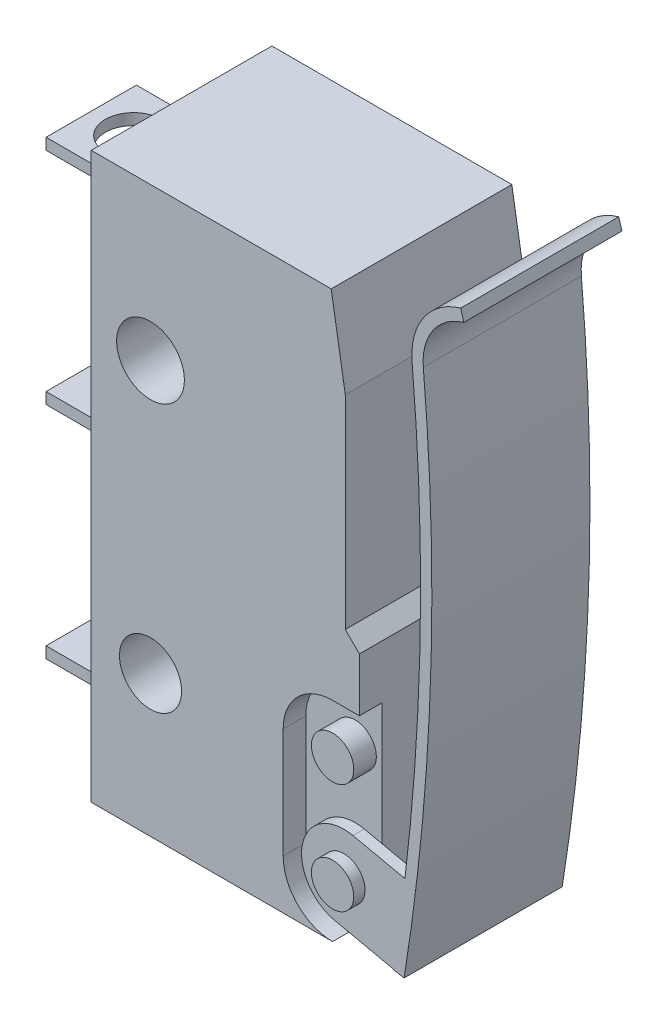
ISO-10303-21;
HEADER;
FILE_DESCRIPTION(('STEP AP214'),'2;1');
FILE_NAME('part.step','',(''),(''),'','','');
FILE_SCHEMA(('AUTOMOTIVE_DESIGN { 1 0 10303 214 1 1 1 1 }'));
ENDSEC;
DATA;
#1=APPLICATION_CONTEXT('core data for automotive mechanical design processes');
#2=APPLICATION_PROTOCOL_DEFINITION('international standard','automotive_design',2000,#1);
#3=PRODUCT_CONTEXT('',#1,'mechanical');
#4=PRODUCT('Part','Part','',(#3));
#5=PRODUCT_RELATED_PRODUCT_CATEGORY('part','',(#4));
#6=PRODUCT_DEFINITION_FORMATION('','',#4);
#7=PRODUCT_DEFINITION_CONTEXT('part definition',#1,'design');
#8=PRODUCT_DEFINITION('design','',#6,#7);
#9=PRODUCT_DEFINITION_SHAPE('','',#8);
#10=(LENGTH_UNIT() NAMED_UNIT(*) SI_UNIT(.MILLI.,.METRE.));
#11=(NAMED_UNIT(*) PLANE_ANGLE_UNIT() SI_UNIT($,.RADIAN.));
#12=(NAMED_UNIT(*) SI_UNIT($,.STERADIAN.) SOLID_ANGLE_UNIT());
#13=UNCERTAINTY_MEASURE_WITH_UNIT(LENGTH_MEASURE(1.E-05),#10,'distance_accuracy_value','');
#14=(GEOMETRIC_REPRESENTATION_CONTEXT(3) GLOBAL_UNCERTAINTY_ASSIGNED_CONTEXT((#13)) GLOBAL_UNIT_ASSIGNED_CONTEXT((#10,
#11,#12)) REPRESENTATION_CONTEXT('',''));
#15=CARTESIAN_POINT('',(0.,0.,0.));
#16=DIRECTION('',(0.,0.,1.));
#17=DIRECTION('',(1.,0.,0.));
#18=AXIS2_PLACEMENT_3D('',#15,#16,#17);
#19=CARTESIAN_POINT('',(-2.1,15.,3.2));
#20=DIRECTION('',(1.,0.,0.));
#21=DIRECTION('',(0.,1.,0.));
#22=AXIS2_PLACEMENT_3D('',#19,#20,#21);
#23=PLANE('',#22);
#24=DIRECTION('',(0.,-1.,0.));
#25=VECTOR('',#24,1.);
#26=CARTESIAN_POINT('',(-2.1,5.2,-1.6));
#27=LINE('',#26,#25);
#28=CARTESIAN_POINT('',(-2.1,5.2,-1.6));
#29=VERTEX_POINT('',#28);
#30=CARTESIAN_POINT('',(-2.1,4.8,-1.6));
#31=VERTEX_POINT('',#30);
#32=EDGE_CURVE('E352',#29,#31,#27,.T.);
#33=ORIENTED_EDGE('',*,*,#32,.F.);
#34=DIRECTION('',(0.,0.,-1.));
#35=VECTOR('',#34,1.);
#36=CARTESIAN_POINT('',(-2.1,5.2,-1.6));
#37=LINE('',#36,#35);
#38=CARTESIAN_POINT('',(-2.1,5.2,1.6));
#39=VERTEX_POINT('',#38);
#40=EDGE_CURVE('E365',#39,#29,#37,.T.);
#41=ORIENTED_EDGE('',*,*,#40,.F.);
#42=DIRECTION('',(0.,1.,0.));
#43=VECTOR('',#42,1.);
#44=CARTESIAN_POINT('',(-2.1,5.2,1.6));
#45=LINE('',#44,#43);
#46=CARTESIAN_POINT('',(-2.1,4.8,1.6));
#47=VERTEX_POINT('',#46);
#48=EDGE_CURVE('E374',#47,#39,#45,.T.);
#49=ORIENTED_EDGE('',*,*,#48,.F.);
#50=DIRECTION('',(0.,0.,1.));
#51=VECTOR('',#50,1.);
#52=CARTESIAN_POINT('',(-2.1,4.8,-1.6));
#53=LINE('',#52,#51);
#54=EDGE_CURVE('E355',#31,#47,#53,.T.);
#55=ORIENTED_EDGE('',*,*,#54,.F.);
#56=EDGE_LOOP('',(#33,#41,#49,#55));
#57=FACE_BOUND('',#56,.T.);
#58=DIRECTION('',(0.,-1.,0.));
#59=VECTOR('',#58,1.);
#60=CARTESIAN_POINT('',(-2.1,15.,-3.2));
#61=LINE('',#60,#59);
#62=CARTESIAN_POINT('',(-2.1,15.,-3.2));
#63=VERTEX_POINT('',#62);
#64=CARTESIAN_POINT('',(-2.1,-5.,-3.2));
#65=VERTEX_POINT('',#64);
#66=EDGE_CURVE('E704',#63,#65,#61,.T.);
#67=ORIENTED_EDGE('',*,*,#66,.T.);
#68=DIRECTION('',(0.,0.,-1.));
#69=VECTOR('',#68,1.);
#70=CARTESIAN_POINT('',(-2.1,-5.,3.2));
#71=LINE('',#70,#69);
#72=CARTESIAN_POINT('',(-2.1,-5.,3.2));
#73=VERTEX_POINT('',#72);
#74=EDGE_CURVE('E747',#73,#65,#71,.T.);
#75=ORIENTED_EDGE('',*,*,#74,.F.);
#76=DIRECTION('',(0.,-1.,0.));
#77=VECTOR('',#76,1.);
#78=CARTESIAN_POINT('',(-2.1,15.,3.2));
#79=LINE('',#78,#77);
#80=CARTESIAN_POINT('',(-2.1,15.,3.2));
#81=VERTEX_POINT('',#80);
#82=EDGE_CURVE('E707',#81,#73,#79,.T.);
#83=ORIENTED_EDGE('',*,*,#82,.F.);
#84=DIRECTION('',(0.,0.,-1.));
#85=VECTOR('',#84,1.);
#86=CARTESIAN_POINT('',(-2.1,15.,3.2));
#87=LINE('',#86,#85);
#88=EDGE_CURVE('E722',#81,#63,#87,.T.);
#89=ORIENTED_EDGE('',*,*,#88,.T.);
#90=EDGE_LOOP('',(#67,#75,#83,#89));
#91=FACE_BOUND('',#90,.T.);
#92=DIRECTION('',(0.,-1.,0.));
#93=VECTOR('',#92,1.);
#94=CARTESIAN_POINT('',(-2.1,13.,-1.6));
#95=LINE('',#94,#93);
#96=CARTESIAN_POINT('',(-2.1,13.,-1.6));
#97=VERTEX_POINT('',#96);
#98=CARTESIAN_POINT('',(-2.1,12.6,-1.6));
#99=VERTEX_POINT('',#98);
#100=EDGE_CURVE('E390',#97,#99,#95,.T.);
#101=ORIENTED_EDGE('',*,*,#100,.F.);
#102=DIRECTION('',(0.,0.,-1.));
#103=VECTOR('',#102,1.);
#104=CARTESIAN_POINT('',(-2.1,13.,-1.6));
#105=LINE('',#104,#103);
#106=CARTESIAN_POINT('',(-2.1,13.,1.6));
#107=VERTEX_POINT('',#106);
#108=EDGE_CURVE('E395',#107,#97,#105,.T.);
#109=ORIENTED_EDGE('',*,*,#108,.F.);
#110=DIRECTION('',(0.,1.,0.));
#111=VECTOR('',#110,1.);
#112=CARTESIAN_POINT('',(-2.1,13.,1.6));
#113=LINE('',#112,#111);
#114=CARTESIAN_POINT('',(-2.1,12.6,1.6));
#115=VERTEX_POINT('',#114);
#116=EDGE_CURVE('E407',#115,#107,#113,.T.);
#117=ORIENTED_EDGE('',*,*,#116,.F.);
#118=DIRECTION('',(0.,0.,1.));
#119=VECTOR('',#118,1.);
#120=CARTESIAN_POINT('',(-2.1,12.6,-1.6));
#121=LINE('',#120,#119);
#122=EDGE_CURVE('E404',#99,#115,#121,.T.);
#123=ORIENTED_EDGE('',*,*,#122,.F.);
#124=EDGE_LOOP('',(#101,#109,#117,#123));
#125=FACE_BOUND('',#124,.T.);
#126=DIRECTION('',(0.,-1.,0.));
#127=VECTOR('',#126,1.);
#128=CARTESIAN_POINT('',(-2.1,-2.6,-1.6));
#129=LINE('',#128,#127);
#130=CARTESIAN_POINT('',(-2.1,-2.6,-1.6));
#131=VERTEX_POINT('',#130);
#132=CARTESIAN_POINT('',(-2.1,-3.,-1.6));
#133=VERTEX_POINT('',#132);
#134=EDGE_CURVE('E351',#131,#133,#129,.T.);
#135=ORIENTED_EDGE('',*,*,#134,.F.);
#136=DIRECTION('',(0.,0.,-1.));
#137=VECTOR('',#136,1.);
#138=CARTESIAN_POINT('',(-2.1,-2.6,-1.6));
#139=LINE('',#138,#137);
#140=CARTESIAN_POINT('',(-2.1,-2.6,1.6));
#141=VERTEX_POINT('',#140);
#142=EDGE_CURVE('E348',#141,#131,#139,.T.);
#143=ORIENTED_EDGE('',*,*,#142,.F.);
#144=DIRECTION('',(0.,1.,0.));
#145=VECTOR('',#144,1.);
#146=CARTESIAN_POINT('',(-2.1,-2.6,1.6));
#147=LINE('',#146,#145);
#148=CARTESIAN_POINT('',(-2.1,-3.,1.6));
#149=VERTEX_POINT('',#148);
#150=EDGE_CURVE('E55',#149,#141,#147,.T.);
#151=ORIENTED_EDGE('',*,*,#150,.F.);
#152=DIRECTION('',(0.,0.,1.));
#153=VECTOR('',#152,1.);
#154=CARTESIAN_POINT('',(-2.1,-3.,-1.6));
#155=LINE('',#154,#153);
#156=EDGE_CURVE('E50',#133,#149,#155,.T.);
#157=ORIENTED_EDGE('',*,*,#156,.F.);
#158=EDGE_LOOP('',(#135,#143,#151,#157));
#159=FACE_BOUND('',#158,.T.);
#160=ADVANCED_FACE('F33',(#57,#91,#125,#159),#23,.F.);
#161=CARTESIAN_POINT('',(6.45,0.649999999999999,2.4));
#162=DIRECTION('',(0.,0.,1.));
#163=DIRECTION('',(1.,0.,0.));
#164=AXIS2_PLACEMENT_3D('',#161,#162,#163);
#165=PLANE('',#164);
#166=CARTESIAN_POINT('',(6.45,0.649999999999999,2.4));
#167=DIRECTION('',(0.,0.,1.));
#168=DIRECTION('',(1.,0.,0.));
#169=AXIS2_PLACEMENT_3D('',#166,#167,#168);
#170=CIRCLE('',#169,0.75);
#171=CARTESIAN_POINT('',(7.2,0.649999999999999,2.4));
#172=VERTEX_POINT('',#171);
#173=EDGE_CURVE('E788',#172,#172,#170,.T.);
#174=ORIENTED_EDGE('',*,*,#173,.F.);
#175=EDGE_LOOP('',(#174));
#176=FACE_BOUND('',#175,.T.);
#177=CARTESIAN_POINT('',(6.45,-3.25,2.4));
#178=DIRECTION('',(0.,0.,1.));
#179=DIRECTION('',(1.,0.,0.));
#180=AXIS2_PLACEMENT_3D('',#177,#178,#179);
#181=CIRCLE('',#180,1.5);
#182=CARTESIAN_POINT('',(6.76918531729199,-1.78435313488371,2.4));
#183=VERTEX_POINT('',#182);
#184=CARTESIAN_POINT('',(6.13081468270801,-4.71564686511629,2.4));
#185=VERTEX_POINT('',#184);
#186=EDGE_CURVE('E888',#183,#185,#181,.T.);
#187=ORIENTED_EDGE('',*,*,#186,.F.);
#188=DIRECTION('',(-0.977097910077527,0.212790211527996,0.));
#189=VECTOR('',#188,1.);
#190=CARTESIAN_POINT('',(6.76918531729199,-1.78435313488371,2.4));
#191=LINE('',#190,#189);
#192=CARTESIAN_POINT('',(7.4,-1.92173055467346,2.4));
#193=VERTEX_POINT('',#192);
#194=EDGE_CURVE('E854',#193,#183,#191,.T.);
#195=ORIENTED_EDGE('',*,*,#194,.F.);
#196=DIRECTION('',(0.,1.,0.));
#197=VECTOR('',#196,1.);
#198=CARTESIAN_POINT('',(7.4,-5.,2.4));
#199=LINE('',#198,#197);
#200=CARTESIAN_POINT('',(7.4,2.4,2.4));
#201=VERTEX_POINT('',#200);
#202=EDGE_CURVE('E804',#193,#201,#199,.T.);
#203=ORIENTED_EDGE('',*,*,#202,.T.);
#204=DIRECTION('',(-1.,0.,0.));
#205=VECTOR('',#204,1.);
#206=CARTESIAN_POINT('',(6.45,2.4,2.4));
#207=LINE('',#206,#205);
#208=CARTESIAN_POINT('',(6.45,2.4,2.4));
#209=VERTEX_POINT('',#208);
#210=EDGE_CURVE('E697',#201,#209,#207,.T.);
#211=ORIENTED_EDGE('',*,*,#210,.T.);
#212=CARTESIAN_POINT('',(6.45,0.649999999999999,2.4));
#213=DIRECTION('',(0.,0.,1.));
#214=DIRECTION('',(1.,0.,0.));
#215=AXIS2_PLACEMENT_3D('',#212,#213,#214);
#216=CIRCLE('',#215,1.75);
#217=CARTESIAN_POINT('',(4.7,0.649999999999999,2.4));
#218=VERTEX_POINT('',#217);
#219=EDGE_CURVE('E794',#209,#218,#216,.T.);
#220=ORIENTED_EDGE('',*,*,#219,.T.);
#221=DIRECTION('',(0.,-1.,0.));
#222=VECTOR('',#221,1.);
#223=CARTESIAN_POINT('',(4.7,0.649999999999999,2.4));
#224=LINE('',#223,#222);
#225=CARTESIAN_POINT('',(4.7,-3.25,2.4));
#226=VERTEX_POINT('',#225);
#227=EDGE_CURVE('E797',#218,#226,#224,.T.);
#228=ORIENTED_EDGE('',*,*,#227,.T.);
#229=CARTESIAN_POINT('',(6.45,-3.25,2.4));
#230=DIRECTION('',(0.,0.,1.));
#231=DIRECTION('',(1.,0.,0.));
#232=AXIS2_PLACEMENT_3D('',#229,#230,#231);
#233=CIRCLE('',#232,1.75);
#234=CARTESIAN_POINT('',(6.45,-5.,2.4));
#235=VERTEX_POINT('',#234);
#236=EDGE_CURVE('E800',#226,#235,#233,.T.);
#237=ORIENTED_EDGE('',*,*,#236,.T.);
#238=DIRECTION('',(1.,0.,0.));
#239=VECTOR('',#238,1.);
#240=CARTESIAN_POINT('',(6.45,-5.,2.4));
#241=LINE('',#240,#239);
#242=CARTESIAN_POINT('',(7.4,-5.,2.4));
#243=VERTEX_POINT('',#242);
#244=EDGE_CURVE('E802',#235,#243,#241,.T.);
#245=ORIENTED_EDGE('',*,*,#244,.T.);
#246=CARTESIAN_POINT('',(7.4,-4.99204722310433,2.4));
#247=VERTEX_POINT('',#246);
#248=EDGE_CURVE('E805',#243,#247,#199,.T.);
#249=ORIENTED_EDGE('',*,*,#248,.T.);
#250=DIRECTION('',(0.977097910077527,-0.212790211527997,0.));
#251=VECTOR('',#250,1.);
#252=CARTESIAN_POINT('',(6.13081468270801,-4.71564686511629,2.4));
#253=LINE('',#252,#251);
#254=EDGE_CURVE('E839',#185,#247,#253,.T.);
#255=ORIENTED_EDGE('',*,*,#254,.F.);
#256=EDGE_LOOP('',(#187,#195,#203,#211,#220,#228,#237,#245,#249,#255));
#257=FACE_BOUND('',#256,.T.);
#258=ADVANCED_FACE('F589',(#176,#257),#165,.T.);
#259=CARTESIAN_POINT('',(7.4,4.3,3.2));
#260=DIRECTION('',(-1.,0.,0.));
#261=DIRECTION('',(0.,-1.,0.));
#262=AXIS2_PLACEMENT_3D('',#259,#260,#261);
#263=PLANE('',#262);
#264=CARTESIAN_POINT('',(7.4,2.,0.));
#265=DIRECTION('',(-1.,0.,0.));
#266=DIRECTION('',(0.,-1.,0.));
#267=AXIS2_PLACEMENT_3D('',#264,#265,#266);
#268=CIRCLE('',#267,1.);
#269=CARTESIAN_POINT('',(7.4,1.,0.));
#270=VERTEX_POINT('',#269);
#271=EDGE_CURVE('E43',#270,#270,#268,.F.);
#272=ORIENTED_EDGE('',*,*,#271,.F.);
#273=EDGE_LOOP('',(#272));
#274=FACE_BOUND('',#273,.T.);
#275=DIRECTION('',(0.,1.,0.));
#276=VECTOR('',#275,1.);
#277=CARTESIAN_POINT('',(7.4,-5.,-2.4));
#278=LINE('',#277,#276);
#279=CARTESIAN_POINT('',(7.4,-5.,-2.4));
#280=VERTEX_POINT('',#279);
#281=CARTESIAN_POINT('',(7.4,-4.99204722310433,-2.4));
#282=VERTEX_POINT('',#281);
#283=EDGE_CURVE('E844',#280,#282,#278,.T.);
#284=ORIENTED_EDGE('',*,*,#283,.T.);
#285=DIRECTION('',(0.,-1.,0.));
#286=VECTOR('',#285,1.);
#287=CARTESIAN_POINT('',(7.4,4.3,-2.4));
#288=LINE('',#287,#286);
#289=CARTESIAN_POINT('',(7.4,-1.92173055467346,-2.4));
#290=VERTEX_POINT('',#289);
#291=EDGE_CURVE('E846',#290,#282,#288,.T.);
#292=ORIENTED_EDGE('',*,*,#291,.F.);
#293=CARTESIAN_POINT('',(7.4,2.4,-2.4));
#294=VERTEX_POINT('',#293);
#295=EDGE_CURVE('E772',#290,#294,#278,.T.);
#296=ORIENTED_EDGE('',*,*,#295,.T.);
#297=DIRECTION('',(0.,0.,-1.));
#298=VECTOR('',#297,1.);
#299=CARTESIAN_POINT('',(7.4,2.4,-2.4));
#300=LINE('',#299,#298);
#301=CARTESIAN_POINT('',(7.4,2.4,-3.2));
#302=VERTEX_POINT('',#301);
#303=EDGE_CURVE('E769',#294,#302,#300,.T.);
#304=ORIENTED_EDGE('',*,*,#303,.T.);
#305=DIRECTION('',(0.,1.,0.));
#306=VECTOR('',#305,1.);
#307=CARTESIAN_POINT('',(7.4,4.3,-3.2));
#308=LINE('',#307,#306);
#309=CARTESIAN_POINT('',(7.4,4.3,-3.2));
#310=VERTEX_POINT('',#309);
#311=EDGE_CURVE('E728',#302,#310,#308,.T.);
#312=ORIENTED_EDGE('',*,*,#311,.T.);
#313=DIRECTION('',(0.,0.,-1.));
#314=VECTOR('',#313,1.);
#315=CARTESIAN_POINT('',(7.4,4.3,3.2));
#316=LINE('',#315,#314);
#317=CARTESIAN_POINT('',(7.4,4.3,3.2));
#318=VERTEX_POINT('',#317);
#319=EDGE_CURVE('E741',#318,#310,#316,.T.);
#320=ORIENTED_EDGE('',*,*,#319,.F.);
#321=DIRECTION('',(0.,1.,0.));
#322=VECTOR('',#321,1.);
#323=CARTESIAN_POINT('',(7.4,4.3,3.2));
#324=LINE('',#323,#322);
#325=CARTESIAN_POINT('',(7.4,2.4,3.2));
#326=VERTEX_POINT('',#325);
#327=EDGE_CURVE('E714',#326,#318,#324,.T.);
#328=ORIENTED_EDGE('',*,*,#327,.F.);
#329=DIRECTION('',(0.,0.,1.));
#330=VECTOR('',#329,1.);
#331=CARTESIAN_POINT('',(7.4,2.4,2.4));
#332=LINE('',#331,#330);
#333=EDGE_CURVE('E680',#201,#326,#332,.T.);
#334=ORIENTED_EDGE('',*,*,#333,.F.);
#335=ORIENTED_EDGE('',*,*,#202,.F.);
#336=DIRECTION('',(0.,1.,0.));
#337=VECTOR('',#336,1.);
#338=CARTESIAN_POINT('',(7.4,4.3,2.4));
#339=LINE('',#338,#337);
#340=EDGE_CURVE('E831',#247,#193,#339,.T.);
#341=ORIENTED_EDGE('',*,*,#340,.F.);
#342=ORIENTED_EDGE('',*,*,#248,.F.);
#343=DIRECTION('',(0.,0.,-1.));
#344=VECTOR('',#343,1.);
#345=CARTESIAN_POINT('',(7.4,-5.,3.2));
#346=LINE('',#345,#344);
#347=EDGE_CURVE('E744',#243,#280,#346,.T.);
#348=ORIENTED_EDGE('',*,*,#347,.T.);
#349=EDGE_LOOP('',(#284,#292,#296,#304,#312,#320,#328,#334,#335,#341,#342,#348));
#350=FACE_BOUND('',#349,.T.);
#351=ADVANCED_FACE('F592',(#274,#350),#263,.F.);
#352=CARTESIAN_POINT('',(-2.1,-5.,-3.2));
#353=DIRECTION('',(0.,0.,1.));
#354=DIRECTION('',(1.,0.,0.));
#355=AXIS2_PLACEMENT_3D('',#352,#353,#354);
#356=PLANE('',#355);
#357=CARTESIAN_POINT('',(0.,9.6,-3.2));
#358=DIRECTION('',(0.,0.,1.));
#359=DIRECTION('',(1.,0.,0.));
#360=AXIS2_PLACEMENT_3D('',#357,#358,#359);
#361=CIRCLE('',#360,1.2);
#362=CARTESIAN_POINT('',(1.2,9.6,-3.2));
#363=VERTEX_POINT('',#362);
#364=EDGE_CURVE('E672',#363,#363,#361,.T.);
#365=ORIENTED_EDGE('',*,*,#364,.T.);
#366=EDGE_LOOP('',(#365));
#367=FACE_BOUND('',#366,.T.);
#368=CARTESIAN_POINT('',(0.,0.,-3.2));
#369=DIRECTION('',(0.,0.,1.));
#370=DIRECTION('',(1.,0.,0.));
#371=AXIS2_PLACEMENT_3D('',#368,#369,#370);
#372=CIRCLE('',#371,1.1);
#373=CARTESIAN_POINT('',(1.1,0.,-3.2));
#374=VERTEX_POINT('',#373);
#375=EDGE_CURVE('E699',#374,#374,#372,.T.);
#376=ORIENTED_EDGE('',*,*,#375,.T.);
#377=EDGE_LOOP('',(#376));
#378=FACE_BOUND('',#377,.T.);
#379=CARTESIAN_POINT('',(6.45,-3.25,-3.2));
#380=DIRECTION('',(0.,0.,1.));
#381=DIRECTION('',(1.,0.,0.));
#382=AXIS2_PLACEMENT_3D('',#379,#380,#381);
#383=CIRCLE('',#382,1.75);
#384=CARTESIAN_POINT('',(4.7,-3.25,-3.2));
#385=VERTEX_POINT('',#384);
#386=CARTESIAN_POINT('',(6.45,-5.,-3.2));
#387=VERTEX_POINT('',#386);
#388=EDGE_CURVE('E920',#385,#387,#383,.T.);
#389=ORIENTED_EDGE('',*,*,#388,.T.);
#390=DIRECTION('',(1.,0.,0.));
#391=VECTOR('',#390,1.);
#392=CARTESIAN_POINT('',(-2.1,-5.,-3.2));
#393=LINE('',#392,#391);
#394=EDGE_CURVE('E725',#65,#387,#393,.T.);
#395=ORIENTED_EDGE('',*,*,#394,.F.);
#396=ORIENTED_EDGE('',*,*,#66,.F.);
#397=DIRECTION('',(-1.,0.,0.));
#398=VECTOR('',#397,1.);
#399=CARTESIAN_POINT('',(-2.1,15.,-3.2));
#400=LINE('',#399,#398);
#401=CARTESIAN_POINT('',(6.4,15.,-3.2));
#402=VERTEX_POINT('',#401);
#403=EDGE_CURVE('E711',#402,#63,#400,.T.);
#404=ORIENTED_EDGE('',*,*,#403,.F.);
#405=DIRECTION('',(-0.164398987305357,0.986393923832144,0.));
#406=VECTOR('',#405,1.);
#407=CARTESIAN_POINT('',(6.4,15.,-3.2));
#408=LINE('',#407,#406);
#409=CARTESIAN_POINT('',(6.9,12.,-3.2));
#410=VERTEX_POINT('',#409);
#411=EDGE_CURVE('E667',#402,#410,#408,.F.);
#412=ORIENTED_EDGE('',*,*,#411,.T.);
#413=DIRECTION('',(0.,1.,0.));
#414=VECTOR('',#413,1.);
#415=CARTESIAN_POINT('',(6.9,15.,-3.2));
#416=LINE('',#415,#414);
#417=CARTESIAN_POINT('',(6.9,4.79999999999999,-3.2));
#418=VERTEX_POINT('',#417);
#419=EDGE_CURVE('E732',#418,#410,#416,.T.);
#420=ORIENTED_EDGE('',*,*,#419,.F.);
#421=DIRECTION('',(-0.707106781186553,0.707106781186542,0.));
#422=VECTOR('',#421,1.);
#423=CARTESIAN_POINT('',(7.4,4.3,-3.2));
#424=LINE('',#423,#422);
#425=EDGE_CURVE('E730',#310,#418,#424,.T.);
#426=ORIENTED_EDGE('',*,*,#425,.F.);
#427=ORIENTED_EDGE('',*,*,#311,.F.);
#428=DIRECTION('',(-1.,0.,0.));
#429=VECTOR('',#428,1.);
#430=CARTESIAN_POINT('',(6.45,2.4,-3.2));
#431=LINE('',#430,#429);
#432=CARTESIAN_POINT('',(6.45,2.4,-3.2));
#433=VERTEX_POINT('',#432);
#434=EDGE_CURVE('E763',#302,#433,#431,.T.);
#435=ORIENTED_EDGE('',*,*,#434,.T.);
#436=CARTESIAN_POINT('',(6.45,0.649999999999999,-3.2));
#437=DIRECTION('',(0.,0.,1.));
#438=DIRECTION('',(1.,0.,0.));
#439=AXIS2_PLACEMENT_3D('',#436,#437,#438);
#440=CIRCLE('',#439,1.75);
#441=CARTESIAN_POINT('',(4.7,0.649999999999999,-3.2));
#442=VERTEX_POINT('',#441);
#443=EDGE_CURVE('E904',#433,#442,#440,.T.);
#444=ORIENTED_EDGE('',*,*,#443,.T.);
#445=DIRECTION('',(0.,-1.,0.));
#446=VECTOR('',#445,1.);
#447=CARTESIAN_POINT('',(4.7,0.649999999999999,-3.2));
#448=LINE('',#447,#446);
#449=EDGE_CURVE('E911',#442,#385,#448,.T.);
#450=ORIENTED_EDGE('',*,*,#449,.T.);
#451=EDGE_LOOP('',(#389,#395,#396,#404,#412,#420,#426,#427,#435,#444,#450));
#452=FACE_BOUND('',#451,.T.);
#453=ADVANCED_FACE('F632',(#367,#378,#452),#356,.F.);
#454=CARTESIAN_POINT('',(-2.1,-5.,3.2));
#455=DIRECTION('',(0.,1.,0.));
#456=DIRECTION('',(0.,0.,1.));
#457=AXIS2_PLACEMENT_3D('',#454,#455,#456);
#458=PLANE('',#457);
#459=DIRECTION('',(1.,0.,0.));
#460=VECTOR('',#459,1.);
#461=CARTESIAN_POINT('',(6.45,-5.,-2.4));
#462=LINE('',#461,#460);
#463=CARTESIAN_POINT('',(6.45,-5.,-2.4));
#464=VERTEX_POINT('',#463);
#465=EDGE_CURVE('E843',#464,#280,#462,.T.);
#466=ORIENTED_EDGE('',*,*,#465,.T.);
#467=ORIENTED_EDGE('',*,*,#347,.F.);
#468=ORIENTED_EDGE('',*,*,#244,.F.);
#469=DIRECTION('',(0.,0.,1.));
#470=VECTOR('',#469,1.);
#471=CARTESIAN_POINT('',(6.45,-5.,2.4));
#472=LINE('',#471,#470);
#473=CARTESIAN_POINT('',(6.45,-5.,3.2));
#474=VERTEX_POINT('',#473);
#475=EDGE_CURVE('E685',#235,#474,#472,.T.);
#476=ORIENTED_EDGE('',*,*,#475,.T.);
#477=DIRECTION('',(1.,0.,0.));
#478=VECTOR('',#477,1.);
#479=CARTESIAN_POINT('',(-2.1,-5.,3.2));
#480=LINE('',#479,#478);
#481=EDGE_CURVE('E710',#73,#474,#480,.T.);
#482=ORIENTED_EDGE('',*,*,#481,.F.);
#483=ORIENTED_EDGE('',*,*,#74,.T.);
#484=ORIENTED_EDGE('',*,*,#394,.T.);
#485=DIRECTION('',(0.,0.,-1.));
#486=VECTOR('',#485,1.);
#487=CARTESIAN_POINT('',(6.45,-5.,-2.4));
#488=LINE('',#487,#486);
#489=EDGE_CURVE('E774',#464,#387,#488,.T.);
#490=ORIENTED_EDGE('',*,*,#489,.F.);
#491=EDGE_LOOP('',(#466,#467,#468,#476,#482,#483,#484,#490));
#492=FACE_BOUND('',#491,.T.);
#493=ADVANCED_FACE('F627',(#492),#458,.F.);
#494=CARTESIAN_POINT('',(-2.1,-5.,3.2));
#495=DIRECTION('',(0.,0.,1.));
#496=DIRECTION('',(1.,0.,0.));
#497=AXIS2_PLACEMENT_3D('',#494,#495,#496);
#498=PLANE('',#497);
#499=DIRECTION('',(-1.,0.,0.));
#500=VECTOR('',#499,1.);
#501=CARTESIAN_POINT('',(6.45,2.4,3.2));
#502=LINE('',#501,#500);
#503=CARTESIAN_POINT('',(6.45,2.4,3.2));
#504=VERTEX_POINT('',#503);
#505=EDGE_CURVE('E688',#326,#504,#502,.T.);
#506=ORIENTED_EDGE('',*,*,#505,.F.);
#507=ORIENTED_EDGE('',*,*,#327,.T.);
#508=DIRECTION('',(-0.707106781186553,0.707106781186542,0.));
#509=VECTOR('',#508,1.);
#510=CARTESIAN_POINT('',(7.4,4.3,3.2));
#511=LINE('',#510,#509);
#512=CARTESIAN_POINT('',(6.9,4.79999999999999,3.2));
#513=VERTEX_POINT('',#512);
#514=EDGE_CURVE('E716',#318,#513,#511,.T.);
#515=ORIENTED_EDGE('',*,*,#514,.T.);
#516=DIRECTION('',(0.,1.,0.));
#517=VECTOR('',#516,1.);
#518=CARTESIAN_POINT('',(6.9,15.,3.2));
#519=LINE('',#518,#517);
#520=CARTESIAN_POINT('',(6.89999999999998,12.0000000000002,3.2));
#521=VERTEX_POINT('',#520);
#522=EDGE_CURVE('E718',#513,#521,#519,.T.);
#523=ORIENTED_EDGE('',*,*,#522,.T.);
#524=DIRECTION('',(0.164398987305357,-0.986393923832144,0.));
#525=VECTOR('',#524,1.);
#526=CARTESIAN_POINT('',(9.41351351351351,-3.08108108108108,3.2));
#527=LINE('',#526,#525);
#528=CARTESIAN_POINT('',(6.4,15.,3.2));
#529=VERTEX_POINT('',#528);
#530=EDGE_CURVE('E658',#521,#529,#527,.F.);
#531=ORIENTED_EDGE('',*,*,#530,.T.);
#532=DIRECTION('',(-1.,0.,0.));
#533=VECTOR('',#532,1.);
#534=CARTESIAN_POINT('',(-2.1,15.,3.2));
#535=LINE('',#534,#533);
#536=EDGE_CURVE('E720',#529,#81,#535,.T.);
#537=ORIENTED_EDGE('',*,*,#536,.T.);
#538=ORIENTED_EDGE('',*,*,#82,.T.);
#539=ORIENTED_EDGE('',*,*,#481,.T.);
#540=CARTESIAN_POINT('',(6.45,-3.25,3.2));
#541=DIRECTION('',(0.,0.,1.));
#542=DIRECTION('',(1.,0.,0.));
#543=AXIS2_PLACEMENT_3D('',#540,#541,#542);
#544=CIRCLE('',#543,1.75);
#545=CARTESIAN_POINT('',(4.7,-3.25,3.2));
#546=VERTEX_POINT('',#545);
#547=EDGE_CURVE('E813',#546,#474,#544,.T.);
#548=ORIENTED_EDGE('',*,*,#547,.F.);
#549=DIRECTION('',(0.,-1.,0.));
#550=VECTOR('',#549,1.);
#551=CARTESIAN_POINT('',(4.7,0.649999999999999,3.2));
#552=LINE('',#551,#550);
#553=CARTESIAN_POINT('',(4.7,0.649999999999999,3.2));
#554=VERTEX_POINT('',#553);
#555=EDGE_CURVE('E811',#554,#546,#552,.T.);
#556=ORIENTED_EDGE('',*,*,#555,.F.);
#557=CARTESIAN_POINT('',(6.45,0.649999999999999,3.2));
#558=DIRECTION('',(0.,0.,1.));
#559=DIRECTION('',(1.,0.,0.));
#560=AXIS2_PLACEMENT_3D('',#557,#558,#559);
#561=CIRCLE('',#560,1.75);
#562=EDGE_CURVE('E791',#504,#554,#561,.T.);
#563=ORIENTED_EDGE('',*,*,#562,.F.);
#564=EDGE_LOOP('',(#506,#507,#515,#523,#531,#537,#538,#539,#548,#556,#563));
#565=FACE_BOUND('',#564,.T.);
#566=CARTESIAN_POINT('',(0.,0.,3.2));
#567=DIRECTION('',(0.,0.,1.));
#568=DIRECTION('',(1.,0.,0.));
#569=AXIS2_PLACEMENT_3D('',#566,#567,#568);
#570=CIRCLE('',#569,1.1);
#571=CARTESIAN_POINT('',(1.1,0.,3.2));
#572=VERTEX_POINT('',#571);
#573=EDGE_CURVE('E701',#572,#572,#570,.T.);
#574=ORIENTED_EDGE('',*,*,#573,.F.);
#575=EDGE_LOOP('',(#574));
#576=FACE_BOUND('',#575,.T.);
#577=CARTESIAN_POINT('',(0.,9.6,3.2));
#578=DIRECTION('',(0.,0.,1.));
#579=DIRECTION('',(1.,0.,0.));
#580=AXIS2_PLACEMENT_3D('',#577,#578,#579);
#581=CIRCLE('',#580,1.2);
#582=CARTESIAN_POINT('',(1.2,9.6,3.2));
#583=VERTEX_POINT('',#582);
#584=EDGE_CURVE('E678',#583,#583,#581,.T.);
#585=ORIENTED_EDGE('',*,*,#584,.F.);
#586=EDGE_LOOP('',(#585));
#587=FACE_BOUND('',#586,.T.);
#588=ADVANCED_FACE('F623',(#565,#576,#587),#498,.T.);
#589=CARTESIAN_POINT('',(7.4,4.3,3.2));
#590=DIRECTION('',(-0.707106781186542,-0.707106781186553,0.));
#591=DIRECTION('',(0.707106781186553,-0.707106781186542,0.));
#592=AXIS2_PLACEMENT_3D('',#589,#590,#591);
#593=PLANE('',#592);
#594=ORIENTED_EDGE('',*,*,#425,.T.);
#595=DIRECTION('',(0.,0.,-1.));
#596=VECTOR('',#595,1.);
#597=CARTESIAN_POINT('',(6.9,4.79999999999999,3.2));
#598=LINE('',#597,#596);
#599=EDGE_CURVE('E738',#513,#418,#598,.T.);
#600=ORIENTED_EDGE('',*,*,#599,.F.);
#601=ORIENTED_EDGE('',*,*,#514,.F.);
#602=ORIENTED_EDGE('',*,*,#319,.T.);
#603=EDGE_LOOP('',(#594,#600,#601,#602));
#604=FACE_BOUND('',#603,.T.);
#605=ADVANCED_FACE('F626',(#604),#593,.F.);
#606=CARTESIAN_POINT('',(6.9,15.,3.2));
#607=DIRECTION('',(-1.,0.,0.));
#608=DIRECTION('',(0.,-1.,0.));
#609=AXIS2_PLACEMENT_3D('',#606,#607,#608);
#610=PLANE('',#609);
#611=ORIENTED_EDGE('',*,*,#419,.T.);
#612=DIRECTION('',(0.,0.,1.));
#613=VECTOR('',#612,1.);
#614=CARTESIAN_POINT('',(6.9,12.,3.2));
#615=LINE('',#614,#613);
#616=EDGE_CURVE('E659',#410,#521,#615,.T.);
#617=ORIENTED_EDGE('',*,*,#616,.T.);
#618=ORIENTED_EDGE('',*,*,#522,.F.);
#619=ORIENTED_EDGE('',*,*,#599,.T.);
#620=EDGE_LOOP('',(#611,#617,#618,#619));
#621=FACE_BOUND('',#620,.T.);
#622=ADVANCED_FACE('F635',(#621),#610,.F.);
#623=CARTESIAN_POINT('',(-2.1,15.,3.2));
#624=DIRECTION('',(0.,-1.,0.));
#625=DIRECTION('',(0.,0.,-1.));
#626=AXIS2_PLACEMENT_3D('',#623,#624,#625);
#627=PLANE('',#626);
#628=ORIENTED_EDGE('',*,*,#536,.F.);
#629=DIRECTION('',(0.,0.,-1.));
#630=VECTOR('',#629,1.);
#631=CARTESIAN_POINT('',(6.4,15.,3.2));
#632=LINE('',#631,#630);
#633=EDGE_CURVE('E661',#529,#402,#632,.T.);
#634=ORIENTED_EDGE('',*,*,#633,.T.);
#635=ORIENTED_EDGE('',*,*,#403,.T.);
#636=ORIENTED_EDGE('',*,*,#88,.F.);
#637=EDGE_LOOP('',(#628,#634,#635,#636));
#638=FACE_BOUND('',#637,.T.);
#639=ADVANCED_FACE('F621',(#638),#627,.F.);
#640=CARTESIAN_POINT('',(0.,0.,3.2));
#641=DIRECTION('',(0.,0.,-1.));
#642=DIRECTION('',(-1.,0.,0.));
#643=AXIS2_PLACEMENT_3D('',#640,#641,#642);
#644=CYLINDRICAL_SURFACE('',#643,1.1);
#645=ORIENTED_EDGE('',*,*,#573,.T.);
#646=EDGE_LOOP('',(#645));
#647=FACE_BOUND('',#646,.T.);
#648=ORIENTED_EDGE('',*,*,#375,.F.);
#649=EDGE_LOOP('',(#648));
#650=FACE_BOUND('',#649,.T.);
#651=ADVANCED_FACE('F617',(#647,#650),#644,.F.);
#652=CARTESIAN_POINT('',(0.,9.6,3.2));
#653=DIRECTION('',(0.,0.,-1.));
#654=DIRECTION('',(-1.,0.,0.));
#655=AXIS2_PLACEMENT_3D('',#652,#653,#654);
#656=CYLINDRICAL_SURFACE('',#655,1.2);
#657=ORIENTED_EDGE('',*,*,#584,.T.);
#658=EDGE_LOOP('',(#657));
#659=FACE_BOUND('',#658,.T.);
#660=ORIENTED_EDGE('',*,*,#364,.F.);
#661=EDGE_LOOP('',(#660));
#662=FACE_BOUND('',#661,.T.);
#663=ADVANCED_FACE('F614',(#659,#662),#656,.F.);
#664=CARTESIAN_POINT('',(6.4,15.,3.2));
#665=DIRECTION('',(-0.986393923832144,-0.164398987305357,0.));
#666=DIRECTION('',(0.164398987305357,-0.986393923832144,0.));
#667=AXIS2_PLACEMENT_3D('',#664,#665,#666);
#668=PLANE('',#667);
#669=ORIENTED_EDGE('',*,*,#530,.F.);
#670=ORIENTED_EDGE('',*,*,#616,.F.);
#671=ORIENTED_EDGE('',*,*,#411,.F.);
#672=ORIENTED_EDGE('',*,*,#633,.F.);
#673=EDGE_LOOP('',(#669,#670,#671,#672));
#674=FACE_BOUND('',#673,.T.);
#675=ADVANCED_FACE('F612',(#674),#668,.F.);
#676=CARTESIAN_POINT('',(9.,2.,0.));
#677=DIRECTION('',(-1.,0.,0.));
#678=DIRECTION('',(0.,-1.,0.));
#679=AXIS2_PLACEMENT_3D('',#676,#677,#678);
#680=CYLINDRICAL_SURFACE('',#679,1.);
#681=CARTESIAN_POINT('',(9.,2.,0.));
#682=DIRECTION('',(1.,0.,0.));
#683=DIRECTION('',(0.,1.,0.));
#684=AXIS2_PLACEMENT_3D('',#681,#682,#683);
#685=CIRCLE('',#684,1.);
#686=CARTESIAN_POINT('',(9.,1.9652893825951,-0.999397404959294));
#687=VERTEX_POINT('',#686);
#688=CARTESIAN_POINT('',(9.,1.96528938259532,0.999397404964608));
#689=VERTEX_POINT('',#688);
#690=EDGE_CURVE('E671',#687,#689,#685,.T.);
#691=ORIENTED_EDGE('',*,*,#690,.F.);
#692=CARTESIAN_POINT('',(8.93020282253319,1.,0.));
#693=CARTESIAN_POINT('',(8.93020307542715,1.00000250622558,0.0560479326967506));
#694=CARTESIAN_POINT('',(8.93057519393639,1.00472811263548,0.112136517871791));
#695=CARTESIAN_POINT('',(8.93204914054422,1.02351122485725,0.222766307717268));
#696=CARTESIAN_POINT('',(8.93315184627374,1.03757995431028,0.277305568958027));
#697=CARTESIAN_POINT('',(8.93603960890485,1.07464038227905,0.383215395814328));
#698=CARTESIAN_POINT('',(8.93782429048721,1.0976271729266,0.434587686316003));
#699=CARTESIAN_POINT('',(8.94200089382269,1.15185738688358,0.532725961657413));
#700=CARTESIAN_POINT('',(8.94439266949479,1.18309882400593,0.579493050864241));
#701=CARTESIAN_POINT('',(8.94969070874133,1.25300496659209,0.667194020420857));
#702=CARTESIAN_POINT('',(8.95259779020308,1.29168148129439,0.708118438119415));
#703=CARTESIAN_POINT('',(8.95880993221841,1.37532676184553,0.782898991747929));
#704=CARTESIAN_POINT('',(8.96211501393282,1.42029586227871,0.816754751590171));
#705=CARTESIAN_POINT('',(8.96900906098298,1.51538522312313,0.876533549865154));
#706=CARTESIAN_POINT('',(8.97259878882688,1.56551943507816,0.902434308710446));
#707=CARTESIAN_POINT('',(8.97992672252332,1.66941510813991,0.945449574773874));
#708=CARTESIAN_POINT('',(8.98366492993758,1.72317660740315,0.96256398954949));
#709=CARTESIAN_POINT('',(8.9911733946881,1.83291588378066,0.987550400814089));
#710=CARTESIAN_POINT('',(8.99494370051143,1.88889780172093,0.995404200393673));
#711=CARTESIAN_POINT('',(9.00239347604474,2.00139119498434,1.00158440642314));
#712=CARTESIAN_POINT('',(9.00607294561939,2.05790267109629,0.999910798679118));
#713=CARTESIAN_POINT('',(9.01323947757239,2.16986668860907,0.987077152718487));
#714=CARTESIAN_POINT('',(9.01672648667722,2.22531893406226,0.975914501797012));
#715=CARTESIAN_POINT('',(9.02341997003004,2.33356938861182,0.944409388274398));
#716=CARTESIAN_POINT('',(9.02662644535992,2.38636760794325,0.924066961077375));
#717=CARTESIAN_POINT('',(9.03268505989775,2.48774315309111,0.8748022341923));
#718=CARTESIAN_POINT('',(9.03553760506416,2.5363252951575,0.845889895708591));
#719=CARTESIAN_POINT('',(9.040838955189,2.62794790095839,0.780292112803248));
#720=CARTESIAN_POINT('',(9.04328776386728,2.67098841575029,0.743606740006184));
#721=CARTESIAN_POINT('',(9.04773886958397,2.75022474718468,0.663572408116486));
#722=CARTESIAN_POINT('',(9.04974193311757,2.78643229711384,0.620235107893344));
#723=CARTESIAN_POINT('',(9.05328064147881,2.85105755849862,0.528079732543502));
#724=CARTESIAN_POINT('',(9.05481629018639,2.87947533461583,0.479261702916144));
#725=CARTESIAN_POINT('',(9.05740160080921,2.9276683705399,0.377611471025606));
#726=CARTESIAN_POINT('',(9.0584520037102,2.94745680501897,0.324785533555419));
#727=CARTESIAN_POINT('',(9.06006088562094,2.97788749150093,0.216554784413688));
#728=CARTESIAN_POINT('',(9.0606193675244,2.98852979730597,0.161149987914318));
#729=CARTESIAN_POINT('',(9.06123977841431,3.00035755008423,0.0493900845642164));
#730=CARTESIAN_POINT('',(9.06130217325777,3.00155186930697,-0.00696408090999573));
#731=CARTESIAN_POINT('',(9.06093118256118,2.99447285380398,-0.119072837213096));
#732=CARTESIAN_POINT('',(9.06049779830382,2.98619954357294,-0.174827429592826));
#733=CARTESIAN_POINT('',(9.05913870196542,2.96042536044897,-0.284140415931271));
#734=CARTESIAN_POINT('',(9.05821311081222,2.9429267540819,-0.337699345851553));
#735=CARTESIAN_POINT('',(9.05587761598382,2.89920383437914,-0.441116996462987));
#736=CARTESIAN_POINT('',(9.05446771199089,2.87297951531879,-0.49097571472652));
#737=CARTESIAN_POINT('',(9.05117726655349,2.81254045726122,-0.585603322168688));
#738=CARTESIAN_POINT('',(9.04929651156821,2.77832209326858,-0.630369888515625));
#739=CARTESIAN_POINT('',(9.04508807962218,2.70287799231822,-0.71352233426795));
#740=CARTESIAN_POINT('',(9.04276040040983,2.66165222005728,-0.751908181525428));
#741=CARTESIAN_POINT('',(9.03769024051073,2.57331678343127,-0.821257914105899));
#742=CARTESIAN_POINT('',(9.0349472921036,2.52620049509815,-0.852213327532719));
#743=CARTESIAN_POINT('',(9.02909775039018,2.4274614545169,-0.905776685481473));
#744=CARTESIAN_POINT('',(9.02599115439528,2.37583866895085,-0.928384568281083));
#745=CARTESIAN_POINT('',(9.01947397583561,2.26946270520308,-0.964651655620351));
#746=CARTESIAN_POINT('',(9.01606290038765,2.21470450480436,-0.978296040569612));
#747=CARTESIAN_POINT('',(9.00902310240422,2.10368812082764,-0.996197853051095));
#748=CARTESIAN_POINT('',(9.00539437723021,2.04742991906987,-1.00045516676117));
#749=CARTESIAN_POINT('',(8.99801105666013,1.93491149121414,-0.999466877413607));
#750=CARTESIAN_POINT('',(8.99425626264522,1.87865141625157,-0.994205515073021));
#751=CARTESIAN_POINT('',(8.98673874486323,1.76781648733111,-0.97430027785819));
#752=CARTESIAN_POINT('',(8.98297602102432,1.71324164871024,-0.959656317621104));
#753=CARTESIAN_POINT('',(8.97556196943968,1.6072790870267,-0.921382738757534));
#754=CARTESIAN_POINT('',(8.97191073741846,1.55589406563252,-0.897745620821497));
#755=CARTESIAN_POINT('',(8.96485100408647,1.45782387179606,-0.842153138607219));
#756=CARTESIAN_POINT('',(8.96144249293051,1.41113850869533,-0.81019811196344));
#757=CARTESIAN_POINT('',(8.95499782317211,1.32383678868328,-0.738902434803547));
#758=CARTESIAN_POINT('',(8.9519613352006,1.28321505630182,-0.699568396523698));
#759=CARTESIAN_POINT('',(8.94637522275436,1.20914547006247,-0.614594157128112));
#760=CARTESIAN_POINT('',(8.94382571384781,1.17569931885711,-0.568952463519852));
#761=CARTESIAN_POINT('',(8.93932268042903,1.11701415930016,-0.472763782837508));
#762=CARTESIAN_POINT('',(8.93736804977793,1.09175991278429,-0.422226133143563));
#763=CARTESIAN_POINT('',(8.93413209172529,1.05012613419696,-0.317647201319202));
#764=CARTESIAN_POINT('',(8.93284994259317,1.03373577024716,-0.263610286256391));
#765=CARTESIAN_POINT('',(8.93135741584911,1.01469215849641,-0.17435313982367));
#766=CARTESIAN_POINT('',(8.93092521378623,1.00918960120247,-0.139718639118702));
#767=CARTESIAN_POINT('',(8.93034783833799,1.00184274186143,-0.0700613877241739));
#768=CARTESIAN_POINT('',(8.93020266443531,0.999998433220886,-0.0350386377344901));
#769=CARTESIAN_POINT('',(8.93020282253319,1.,0.));
#770=B_SPLINE_CURVE_WITH_KNOTS('',3,(#692,#693,#694,#695,#696,#697,#698,#699,#700,#701,#702,
#703,#704,#705,#706,#707,#708,#709,#710,#711,#712,#713,#714,#715,#716,#717,#718,#719,#720,#721,
#722,#723,#724,#725,#726,#727,#728,#729,#730,#731,#732,#733,#734,#735,#736,#737,#738,#739,#740,
#741,#742,#743,#744,#745,#746,#747,#748,#749,#750,#751,#752,#753,#754,#755,#756,#757,#758,#759,
#760,#761,#762,#763,#764,#765,#766,#767,#768,#769),.UNSPECIFIED.,.T.,.F.,(4,2,2,2,2,2,2,2,2,2,2,
2,2,2,2,2,2,2,2,2,2,2,2,2,2,2,2,2,2,2,2,2,2,2,2,2,2,2,4),(0.,0.168015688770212,
0.336233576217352,0.504359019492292,0.672444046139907,0.840798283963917,1.00916147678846,
1.17799199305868,1.34682428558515,1.51598777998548,1.68515152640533,1.85436186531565,
2.02357155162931,2.19258532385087,2.36159753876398,2.53031683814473,2.69903473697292,
2.86749413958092,3.03595255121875,3.20425275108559,3.37255251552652,3.54081095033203,
3.70906949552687,3.87740448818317,4.04574032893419,4.2142671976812,4.38279531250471,
4.5516013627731,4.72040945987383,4.88949729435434,5.05858666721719,5.2278173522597,
5.39704116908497,5.56611406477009,5.73522703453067,5.90402360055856,6.07261342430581,
6.17764943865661,6.28268526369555),.UNSPECIFIED.);
#771=EDGE_CURVE('E490',#687,#689,#770,.T.);
#772=ORIENTED_EDGE('',*,*,#771,.T.);
#773=EDGE_LOOP('',(#691,#772));
#774=FACE_BOUND('',#773,.T.);
#775=ORIENTED_EDGE('',*,*,#271,.T.);
#776=EDGE_LOOP('',(#775));
#777=FACE_BOUND('',#776,.T.);
#778=ADVANCED_FACE('F608',(#774,#777),#680,.T.);
#779=CARTESIAN_POINT('',(7.95,2.,0.));
#780=DIRECTION('',(0.,0.,1.));
#781=DIRECTION('',(1.,0.,0.));
#782=AXIS2_PLACEMENT_3D('',#779,#780,#781);
#783=SPHERICAL_SURFACE('',#782,1.45);
#784=CARTESIAN_POINT('',(8.99979999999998,1.96225813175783,-0.999497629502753));
#785=CARTESIAN_POINT('',(9.0035408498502,2.01890223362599,-0.997756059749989));
#786=CARTESIAN_POINT('',(9.00720321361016,2.07538656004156,-0.991155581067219));
#787=CARTESIAN_POINT('',(9.01428584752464,2.18644843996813,-0.968621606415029));
#788=CARTESIAN_POINT('',(9.01770624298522,2.24102697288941,-0.952692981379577));
#789=CARTESIAN_POINT('',(9.02422563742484,2.34678064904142,-0.911873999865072));
#790=CARTESIAN_POINT('',(9.02732446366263,2.3979539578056,-0.886978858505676));
#791=CARTESIAN_POINT('',(9.03313525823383,2.49538960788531,-0.82893228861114));
#792=CARTESIAN_POINT('',(9.03584732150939,2.54165315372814,-0.795782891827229));
#793=CARTESIAN_POINT('',(9.04083389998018,2.62788708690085,-0.722187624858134));
#794=CARTESIAN_POINT('',(9.04310896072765,2.66786530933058,-0.681750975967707));
#795=CARTESIAN_POINT('',(9.04719153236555,2.74043116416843,-0.594683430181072));
#796=CARTESIAN_POINT('',(9.04899898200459,2.77301782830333,-0.548051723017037));
#797=CARTESIAN_POINT('',(9.05211203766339,2.82963466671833,-0.450254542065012));
#798=CARTESIAN_POINT('',(9.0534208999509,2.85372028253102,-0.399121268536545));
#799=CARTESIAN_POINT('',(9.05553922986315,2.89291821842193,-0.293517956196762));
#800=CARTESIAN_POINT('',(9.05634874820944,2.90803144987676,-0.239048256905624));
#801=CARTESIAN_POINT('',(9.05745741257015,2.92877342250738,-0.12866120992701));
#802=CARTESIAN_POINT('',(9.05775954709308,2.93445769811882,-0.0727543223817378));
#803=CARTESIAN_POINT('',(9.05786004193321,2.93634568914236,0.0392203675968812));
#804=CARTESIAN_POINT('',(9.05765840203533,2.93254940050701,0.0952881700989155));
#805=CARTESIAN_POINT('',(9.05675432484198,2.91561169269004,0.205837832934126));
#806=CARTESIAN_POINT('',(9.05605320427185,2.90249484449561,0.260323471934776));
#807=CARTESIAN_POINT('',(9.05415818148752,2.86733009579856,0.366322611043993));
#808=CARTESIAN_POINT('',(9.05296427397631,2.84528209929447,0.417836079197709));
#809=CARTESIAN_POINT('',(9.05009348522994,2.79285034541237,0.516539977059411));
#810=CARTESIAN_POINT('',(9.04841569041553,2.76245082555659,0.563722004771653));
#811=CARTESIAN_POINT('',(9.04459865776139,2.69422014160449,0.652336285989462));
#812=CARTESIAN_POINT('',(9.04245945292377,2.65638950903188,0.6937689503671));
#813=CARTESIAN_POINT('',(9.03773762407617,2.57416284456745,0.7699529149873));
#814=CARTESIAN_POINT('',(9.03515272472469,2.52973329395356,0.804667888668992));
#815=CARTESIAN_POINT('',(9.02958913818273,2.43569859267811,0.8662103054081));
#816=CARTESIAN_POINT('',(9.02661023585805,2.38609061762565,0.893033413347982));
#817=CARTESIAN_POINT('',(9.02029463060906,2.28274024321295,0.93821342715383));
#818=CARTESIAN_POINT('',(9.01695539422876,2.22896943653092,0.95650483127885));
#819=CARTESIAN_POINT('',(9.0100175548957,2.11922604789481,0.983790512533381));
#820=CARTESIAN_POINT('',(9.00641954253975,2.06325860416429,0.992805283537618));
#821=CARTESIAN_POINT('',(9.00176554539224,1.99210528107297,0.9982253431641));
#822=CARTESIAN_POINT('',(9.00078514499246,1.97718356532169,0.999028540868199));
#823=CARTESIAN_POINT('',(8.9998,1.96225813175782,0.999497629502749));
#824=B_SPLINE_CURVE_WITH_KNOTS('',3,(#784,#785,#786,#787,#788,#789,#790,#791,#792,#793,#794,
#795,#796,#797,#798,#799,#800,#801,#802,#803,#804,#805,#806,#807,#808,#809,#810,#811,#812,#813,
#814,#815,#816,#817,#818,#819,#820,#821,#822,#823),.UNSPECIFIED.,.F.,.F.,(4,2,2,2,2,2,2,2,2,2,2,
2,2,2,2,2,2,2,2,4),(0.,0.170162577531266,0.340236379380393,0.510401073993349,0.680523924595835,
0.850432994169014,1.02036430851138,1.18916595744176,1.35795045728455,1.52573727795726,
1.69352417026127,1.86087037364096,2.02821837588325,2.19588442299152,2.36353848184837,
2.53207525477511,2.70070443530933,2.87060777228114,3.04013494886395,3.08504493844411),.UNSPECIFIED.);
#825=EDGE_CURVE('E483',#687,#689,#824,.T.);
#826=ORIENTED_EDGE('',*,*,#825,.F.);
#827=ORIENTED_EDGE('',*,*,#690,.T.);
#828=EDGE_LOOP('',(#826,#827));
#829=FACE_BOUND('',#828,.T.);
#830=ADVANCED_FACE('F35',(#829),#783,.T.);
#831=CARTESIAN_POINT('',(6.45,0.649999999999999,2.4));
#832=DIRECTION('',(0.,0.,1.));
#833=DIRECTION('',(1.,0.,0.));
#834=AXIS2_PLACEMENT_3D('',#831,#832,#833);
#835=CYLINDRICAL_SURFACE('',#834,1.75);
#836=ORIENTED_EDGE('',*,*,#562,.T.);
#837=DIRECTION('',(0.,0.,1.));
#838=VECTOR('',#837,1.);
#839=CARTESIAN_POINT('',(4.7,0.649999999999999,2.4));
#840=LINE('',#839,#838);
#841=EDGE_CURVE('E695',#218,#554,#840,.T.);
#842=ORIENTED_EDGE('',*,*,#841,.F.);
#843=ORIENTED_EDGE('',*,*,#219,.F.);
#844=DIRECTION('',(0.,0.,1.));
#845=VECTOR('',#844,1.);
#846=CARTESIAN_POINT('',(6.45,2.4,2.4));
#847=LINE('',#846,#845);
#848=EDGE_CURVE('E673',#209,#504,#847,.T.);
#849=ORIENTED_EDGE('',*,*,#848,.T.);
#850=EDGE_LOOP('',(#836,#842,#843,#849));
#851=FACE_BOUND('',#850,.T.);
#852=ADVANCED_FACE('F598',(#851),#835,.F.);
#853=CARTESIAN_POINT('',(6.45,2.4,2.4));
#854=DIRECTION('',(0.,1.,0.));
#855=DIRECTION('',(0.,0.,1.));
#856=AXIS2_PLACEMENT_3D('',#853,#854,#855);
#857=PLANE('',#856);
#858=ORIENTED_EDGE('',*,*,#505,.T.);
#859=ORIENTED_EDGE('',*,*,#848,.F.);
#860=ORIENTED_EDGE('',*,*,#210,.F.);
#861=ORIENTED_EDGE('',*,*,#333,.T.);
#862=EDGE_LOOP('',(#858,#859,#860,#861));
#863=FACE_BOUND('',#862,.T.);
#864=ADVANCED_FACE('F594',(#863),#857,.F.);
#865=CARTESIAN_POINT('',(6.45,-3.25,2.4));
#866=DIRECTION('',(0.,0.,1.));
#867=DIRECTION('',(1.,0.,0.));
#868=AXIS2_PLACEMENT_3D('',#865,#866,#867);
#869=CYLINDRICAL_SURFACE('',#868,1.75);
#870=ORIENTED_EDGE('',*,*,#547,.T.);
#871=ORIENTED_EDGE('',*,*,#475,.F.);
#872=ORIENTED_EDGE('',*,*,#236,.F.);
#873=DIRECTION('',(0.,0.,1.));
#874=VECTOR('',#873,1.);
#875=CARTESIAN_POINT('',(4.7,-3.25,2.4));
#876=LINE('',#875,#874);
#877=EDGE_CURVE('E693',#226,#546,#876,.T.);
#878=ORIENTED_EDGE('',*,*,#877,.T.);
#879=EDGE_LOOP('',(#870,#871,#872,#878));
#880=FACE_BOUND('',#879,.T.);
#881=ADVANCED_FACE('F597',(#880),#869,.F.);
#882=CARTESIAN_POINT('',(4.7,0.649999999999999,2.4));
#883=DIRECTION('',(-1.,0.,0.));
#884=DIRECTION('',(0.,-1.,0.));
#885=AXIS2_PLACEMENT_3D('',#882,#883,#884);
#886=PLANE('',#885);
#887=ORIENTED_EDGE('',*,*,#555,.T.);
#888=ORIENTED_EDGE('',*,*,#877,.F.);
#889=ORIENTED_EDGE('',*,*,#227,.F.);
#890=ORIENTED_EDGE('',*,*,#841,.T.);
#891=EDGE_LOOP('',(#887,#888,#889,#890));
#892=FACE_BOUND('',#891,.T.);
#893=ADVANCED_FACE('F587',(#892),#886,.F.);
#894=CARTESIAN_POINT('',(6.45,0.649999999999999,2.4));
#895=DIRECTION('',(0.,0.,1.));
#896=DIRECTION('',(1.,0.,0.));
#897=AXIS2_PLACEMENT_3D('',#894,#895,#896);
#898=CYLINDRICAL_SURFACE('',#897,0.75);
#899=ORIENTED_EDGE('',*,*,#173,.T.);
#900=EDGE_LOOP('',(#899));
#901=FACE_BOUND('',#900,.T.);
#902=CARTESIAN_POINT('',(6.45,0.649999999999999,3.2));
#903=DIRECTION('',(0.,0.,1.));
#904=DIRECTION('',(1.,0.,0.));
#905=AXIS2_PLACEMENT_3D('',#902,#903,#904);
#906=CIRCLE('',#905,0.75);
#907=CARTESIAN_POINT('',(7.2,0.649999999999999,3.2));
#908=VERTEX_POINT('',#907);
#909=EDGE_CURVE('E786',#908,#908,#906,.T.);
#910=ORIENTED_EDGE('',*,*,#909,.F.);
#911=EDGE_LOOP('',(#910));
#912=FACE_BOUND('',#911,.T.);
#913=ADVANCED_FACE('F584',(#901,#912),#898,.T.);
#914=ORIENTED_EDGE('',*,*,#909,.T.);
#915=EDGE_LOOP('',(#914));
#916=FACE_BOUND('',#915,.T.);
#917=ADVANCED_FACE('F565',(#916),#498,.T.);
#918=CARTESIAN_POINT('',(6.45,0.649999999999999,-2.4));
#919=DIRECTION('',(0.,0.,-1.));
#920=DIRECTION('',(1.,0.,0.));
#921=AXIS2_PLACEMENT_3D('',#918,#919,#920);
#922=PLANE('',#921);
#923=DIRECTION('',(0.977097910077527,-0.212790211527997,0.));
#924=VECTOR('',#923,1.);
#925=CARTESIAN_POINT('',(6.13081468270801,-4.71564686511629,-2.4));
#926=LINE('',#925,#924);
#927=CARTESIAN_POINT('',(6.13081468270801,-4.71564686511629,-2.4));
#928=VERTEX_POINT('',#927);
#929=EDGE_CURVE('E858',#928,#282,#926,.T.);
#930=ORIENTED_EDGE('',*,*,#929,.T.);
#931=ORIENTED_EDGE('',*,*,#283,.F.);
#932=ORIENTED_EDGE('',*,*,#465,.F.);
#933=CARTESIAN_POINT('',(6.45,-3.25,-2.4));
#934=DIRECTION('',(0.,0.,1.));
#935=DIRECTION('',(1.,0.,0.));
#936=AXIS2_PLACEMENT_3D('',#933,#934,#935);
#937=CIRCLE('',#936,1.75);
#938=CARTESIAN_POINT('',(4.7,-3.25,-2.4));
#939=VERTEX_POINT('',#938);
#940=EDGE_CURVE('E914',#939,#464,#937,.T.);
#941=ORIENTED_EDGE('',*,*,#940,.F.);
#942=DIRECTION('',(0.,-1.,0.));
#943=VECTOR('',#942,1.);
#944=CARTESIAN_POINT('',(4.7,0.649999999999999,-2.4));
#945=LINE('',#944,#943);
#946=CARTESIAN_POINT('',(4.7,0.649999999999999,-2.4));
#947=VERTEX_POINT('',#946);
#948=EDGE_CURVE('E779',#947,#939,#945,.T.);
#949=ORIENTED_EDGE('',*,*,#948,.F.);
#950=CARTESIAN_POINT('',(6.45,0.649999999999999,-2.4));
#951=DIRECTION('',(0.,0.,1.));
#952=DIRECTION('',(1.,0.,0.));
#953=AXIS2_PLACEMENT_3D('',#950,#951,#952);
#954=CIRCLE('',#953,1.75);
#955=CARTESIAN_POINT('',(6.45,2.4,-2.4));
#956=VERTEX_POINT('',#955);
#957=EDGE_CURVE('E907',#956,#947,#954,.T.);
#958=ORIENTED_EDGE('',*,*,#957,.F.);
#959=DIRECTION('',(-1.,0.,0.));
#960=VECTOR('',#959,1.);
#961=CARTESIAN_POINT('',(6.45,2.4,-2.4));
#962=LINE('',#961,#960);
#963=EDGE_CURVE('E910',#294,#956,#962,.T.);
#964=ORIENTED_EDGE('',*,*,#963,.F.);
#965=ORIENTED_EDGE('',*,*,#295,.F.);
#966=DIRECTION('',(-0.977097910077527,0.212790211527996,0.));
#967=VECTOR('',#966,1.);
#968=CARTESIAN_POINT('',(6.76918531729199,-1.78435313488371,-2.4));
#969=LINE('',#968,#967);
#970=CARTESIAN_POINT('',(6.76918531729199,-1.78435313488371,-2.4));
#971=VERTEX_POINT('',#970);
#972=EDGE_CURVE('E868',#290,#971,#969,.T.);
#973=ORIENTED_EDGE('',*,*,#972,.T.);
#974=CARTESIAN_POINT('',(6.45,-3.25,-2.4));
#975=DIRECTION('',(0.,0.,1.));
#976=DIRECTION('',(1.,0.,0.));
#977=AXIS2_PLACEMENT_3D('',#974,#975,#976);
#978=CIRCLE('',#977,1.5);
#979=EDGE_CURVE('E861',#971,#928,#978,.T.);
#980=ORIENTED_EDGE('',*,*,#979,.T.);
#981=EDGE_LOOP('',(#930,#931,#932,#941,#949,#958,#964,#965,#973,#980));
#982=FACE_BOUND('',#981,.T.);
#983=CARTESIAN_POINT('',(6.45,0.649999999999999,-2.4));
#984=DIRECTION('',(0.,0.,1.));
#985=DIRECTION('',(1.,0.,0.));
#986=AXIS2_PLACEMENT_3D('',#983,#984,#985);
#987=CIRCLE('',#986,0.75);
#988=CARTESIAN_POINT('',(7.2,0.649999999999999,-2.4));
#989=VERTEX_POINT('',#988);
#990=EDGE_CURVE('E901',#989,#989,#987,.T.);
#991=ORIENTED_EDGE('',*,*,#990,.T.);
#992=EDGE_LOOP('',(#991));
#993=FACE_BOUND('',#992,.T.);
#994=ADVANCED_FACE('F561',(#982,#993),#922,.T.);
#995=CARTESIAN_POINT('',(6.45,0.649999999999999,-2.4));
#996=DIRECTION('',(0.,0.,-1.));
#997=DIRECTION('',(-1.,0.,0.));
#998=AXIS2_PLACEMENT_3D('',#995,#996,#997);
#999=CYLINDRICAL_SURFACE('',#998,1.75);
#1000=ORIENTED_EDGE('',*,*,#443,.F.);
#1001=DIRECTION('',(0.,0.,-1.));
#1002=VECTOR('',#1001,1.);
#1003=CARTESIAN_POINT('',(6.45,2.4,-2.4));
#1004=LINE('',#1003,#1002);
#1005=EDGE_CURVE('E775',#956,#433,#1004,.T.);
#1006=ORIENTED_EDGE('',*,*,#1005,.F.);
#1007=ORIENTED_EDGE('',*,*,#957,.T.);
#1008=DIRECTION('',(0.,0.,-1.));
#1009=VECTOR('',#1008,1.);
#1010=CARTESIAN_POINT('',(4.7,0.649999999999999,-2.4));
#1011=LINE('',#1010,#1009);
#1012=EDGE_CURVE('E787',#947,#442,#1011,.T.);
#1013=ORIENTED_EDGE('',*,*,#1012,.T.);
#1014=EDGE_LOOP('',(#1000,#1006,#1007,#1013));
#1015=FACE_BOUND('',#1014,.T.);
#1016=ADVANCED_FACE('F564',(#1015),#999,.F.);
#1017=CARTESIAN_POINT('',(4.7,0.649999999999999,-2.4));
#1018=DIRECTION('',(1.,0.,0.));
#1019=DIRECTION('',(0.,1.,0.));
#1020=AXIS2_PLACEMENT_3D('',#1017,#1018,#1019);
#1021=PLANE('',#1020);
#1022=ORIENTED_EDGE('',*,*,#449,.F.);
#1023=ORIENTED_EDGE('',*,*,#1012,.F.);
#1024=ORIENTED_EDGE('',*,*,#948,.T.);
#1025=DIRECTION('',(0.,0.,-1.));
#1026=VECTOR('',#1025,1.);
#1027=CARTESIAN_POINT('',(4.7,-3.25,-2.4));
#1028=LINE('',#1027,#1026);
#1029=EDGE_CURVE('E777',#939,#385,#1028,.T.);
#1030=ORIENTED_EDGE('',*,*,#1029,.T.);
#1031=EDGE_LOOP('',(#1022,#1023,#1024,#1030));
#1032=FACE_BOUND('',#1031,.T.);
#1033=ADVANCED_FACE('F567',(#1032),#1021,.T.);
#1034=CARTESIAN_POINT('',(6.45,-3.25,-2.4));
#1035=DIRECTION('',(0.,0.,-1.));
#1036=DIRECTION('',(-1.,0.,0.));
#1037=AXIS2_PLACEMENT_3D('',#1034,#1035,#1036);
#1038=CYLINDRICAL_SURFACE('',#1037,1.75);
#1039=ORIENTED_EDGE('',*,*,#388,.F.);
#1040=ORIENTED_EDGE('',*,*,#1029,.F.);
#1041=ORIENTED_EDGE('',*,*,#940,.T.);
#1042=ORIENTED_EDGE('',*,*,#489,.T.);
#1043=EDGE_LOOP('',(#1039,#1040,#1041,#1042));
#1044=FACE_BOUND('',#1043,.T.);
#1045=ADVANCED_FACE('F570',(#1044),#1038,.F.);
#1046=CARTESIAN_POINT('',(6.45,2.4,-2.4));
#1047=DIRECTION('',(0.,-1.,0.));
#1048=DIRECTION('',(0.,0.,-1.));
#1049=AXIS2_PLACEMENT_3D('',#1046,#1047,#1048);
#1050=PLANE('',#1049);
#1051=ORIENTED_EDGE('',*,*,#434,.F.);
#1052=ORIENTED_EDGE('',*,*,#303,.F.);
#1053=ORIENTED_EDGE('',*,*,#963,.T.);
#1054=ORIENTED_EDGE('',*,*,#1005,.T.);
#1055=EDGE_LOOP('',(#1051,#1052,#1053,#1054));
#1056=FACE_BOUND('',#1055,.T.);
#1057=ADVANCED_FACE('F559',(#1056),#1050,.T.);
#1058=CARTESIAN_POINT('',(6.45,0.649999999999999,-2.4));
#1059=DIRECTION('',(0.,0.,-1.));
#1060=DIRECTION('',(-1.,0.,0.));
#1061=AXIS2_PLACEMENT_3D('',#1058,#1059,#1060);
#1062=CYLINDRICAL_SURFACE('',#1061,0.75);
#1063=ORIENTED_EDGE('',*,*,#990,.F.);
#1064=EDGE_LOOP('',(#1063));
#1065=FACE_BOUND('',#1064,.T.);
#1066=CARTESIAN_POINT('',(6.45,0.649999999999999,-3.2));
#1067=DIRECTION('',(0.,0.,1.));
#1068=DIRECTION('',(1.,0.,0.));
#1069=AXIS2_PLACEMENT_3D('',#1066,#1067,#1068);
#1070=CIRCLE('',#1069,0.75);
#1071=CARTESIAN_POINT('',(7.2,0.649999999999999,-3.2));
#1072=VERTEX_POINT('',#1071);
#1073=EDGE_CURVE('E900',#1072,#1072,#1070,.T.);
#1074=ORIENTED_EDGE('',*,*,#1073,.T.);
#1075=EDGE_LOOP('',(#1074));
#1076=FACE_BOUND('',#1075,.T.);
#1077=ADVANCED_FACE('F556',(#1065,#1076),#1062,.T.);
#1078=ORIENTED_EDGE('',*,*,#1073,.F.);
#1079=EDGE_LOOP('',(#1078));
#1080=FACE_BOUND('',#1079,.T.);
#1081=ADVANCED_FACE('F535',(#1080),#356,.F.);
#1082=CARTESIAN_POINT('',(-67.4339119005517,7.00682799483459,2.4));
#1083=DIRECTION('',(0.,0.,1.));
#1084=DIRECTION('',(1.,0.,0.));
#1085=AXIS2_PLACEMENT_3D('',#1082,#1083,#1084);
#1086=PLANE('',#1085);
#1087=CARTESIAN_POINT('',(8.61249412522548,-2.18578483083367,2.4));
#1088=VERTEX_POINT('',#1087);
#1089=EDGE_CURVE('E886',#1088,#193,#191,.T.);
#1090=ORIENTED_EDGE('',*,*,#1089,.F.);
#1091=CARTESIAN_POINT('',(-67.4339119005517,7.00682799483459,2.4));
#1092=DIRECTION('',(0.,0.,1.));
#1093=DIRECTION('',(1.,0.,0.));
#1094=AXIS2_PLACEMENT_3D('',#1091,#1092,#1093);
#1095=CIRCLE('',#1094,76.6);
#1096=CARTESIAN_POINT('',(8.1928914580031,-5.16472136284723,2.4));
#1097=VERTEX_POINT('',#1096);
#1098=EDGE_CURVE('E477',#1088,#1097,#1095,.F.);
#1099=ORIENTED_EDGE('',*,*,#1098,.T.);
#1100=EDGE_CURVE('E891',#247,#1097,#253,.T.);
#1101=ORIENTED_EDGE('',*,*,#1100,.F.);
#1102=ORIENTED_EDGE('',*,*,#340,.T.);
#1103=EDGE_LOOP('',(#1090,#1099,#1101,#1102));
#1104=FACE_BOUND('',#1103,.T.);
#1105=ADVANCED_FACE('F531',(#1104),#1086,.F.);
#1106=CARTESIAN_POINT('',(-67.4339119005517,7.00682799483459,2.8));
#1107=DIRECTION('',(0.,0.,1.));
#1108=DIRECTION('',(1.,0.,0.));
#1109=AXIS2_PLACEMENT_3D('',#1106,#1107,#1108);
#1110=PLANE('',#1109);
#1111=DIRECTION('',(0.977097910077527,-0.212790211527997,0.));
#1112=VECTOR('',#1111,1.);
#1113=CARTESIAN_POINT('',(6.13081468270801,-4.71564686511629,2.8));
#1114=LINE('',#1113,#1112);
#1115=CARTESIAN_POINT('',(6.13081468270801,-4.71564686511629,2.8));
#1116=VERTEX_POINT('',#1115);
#1117=CARTESIAN_POINT('',(8.19289145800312,-5.16472136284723,2.8));
#1118=VERTEX_POINT('',#1117);
#1119=EDGE_CURVE('E882',#1116,#1118,#1114,.T.);
#1120=ORIENTED_EDGE('',*,*,#1119,.T.);
#1121=CARTESIAN_POINT('',(-67.4339119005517,7.00682799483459,2.8));
#1122=DIRECTION('',(0.,0.,1.));
#1123=DIRECTION('',(1.,0.,0.));
#1124=AXIS2_PLACEMENT_3D('',#1121,#1122,#1123);
#1125=CIRCLE('',#1124,76.6);
#1126=CARTESIAN_POINT('',(8.18941645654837,-5.18629335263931,2.8));
#1127=VERTEX_POINT('',#1126);
#1128=EDGE_CURVE('E441',#1118,#1127,#1125,.F.);
#1129=ORIENTED_EDGE('',*,*,#1128,.T.);
#1130=DIRECTION('',(-0.987249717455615,0.159179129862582,0.));
#1131=VECTOR('',#1130,1.);
#1132=CARTESIAN_POINT('',(8.58431634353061,-5.24996500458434,2.8));
#1133=LINE('',#1132,#1131);
#1134=CARTESIAN_POINT('',(8.58431634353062,-5.24996500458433,2.8));
#1135=VERTEX_POINT('',#1134);
#1136=EDGE_CURVE('E438',#1135,#1127,#1133,.T.);
#1137=ORIENTED_EDGE('',*,*,#1136,.F.);
#1138=CARTESIAN_POINT('',(-67.4339119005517,7.00682799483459,2.8));
#1139=DIRECTION('',(0.,0.,1.));
#1140=DIRECTION('',(1.,0.,0.));
#1141=AXIS2_PLACEMENT_3D('',#1138,#1139,#1140);
#1142=CIRCLE('',#1141,77.);
#1143=CARTESIAN_POINT('',(9.26380890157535,13.8229576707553,2.8));
#1144=VERTEX_POINT('',#1143);
#1145=EDGE_CURVE('E876',#1135,#1144,#1142,.T.);
#1146=ORIENTED_EDGE('',*,*,#1145,.T.);
#1147=CARTESIAN_POINT('',(11.2559574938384,14.,2.8));
#1148=DIRECTION('',(0.,0.,1.));
#1149=DIRECTION('',(1.,0.,0.));
#1150=AXIS2_PLACEMENT_3D('',#1147,#1148,#1149);
#1151=CIRCLE('',#1150,2.);
#1152=CARTESIAN_POINT('',(10.7,15.9211744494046,2.8));
#1153=VERTEX_POINT('',#1152);
#1154=EDGE_CURVE('E434',#1153,#1144,#1151,.T.);
#1155=ORIENTED_EDGE('',*,*,#1154,.F.);
#1156=DIRECTION('',(0.2779787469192,-0.960587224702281,0.));
#1157=VECTOR('',#1156,1.);
#1158=CARTESIAN_POINT('',(10.5888085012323,16.3054093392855,2.8));
#1159=LINE('',#1158,#1157);
#1160=CARTESIAN_POINT('',(10.5888085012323,16.3054093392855,2.8));
#1161=VERTEX_POINT('',#1160);
#1162=EDGE_CURVE('E429',#1161,#1153,#1159,.T.);
#1163=ORIENTED_EDGE('',*,*,#1162,.F.);
#1164=CARTESIAN_POINT('',(11.2559574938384,14.,2.8));
#1165=DIRECTION('',(0.,0.,1.));
#1166=DIRECTION('',(1.,0.,0.));
#1167=AXIS2_PLACEMENT_3D('',#1164,#1165,#1166);
#1168=CIRCLE('',#1167,2.4);
#1169=CARTESIAN_POINT('',(8.86537918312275,13.7875492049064,2.8));
#1170=VERTEX_POINT('',#1169);
#1171=EDGE_CURVE('E424',#1161,#1170,#1168,.T.);
#1172=ORIENTED_EDGE('',*,*,#1171,.T.);
#1173=CARTESIAN_POINT('',(8.61249412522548,-2.18578483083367,2.8));
#1174=VERTEX_POINT('',#1173);
#1175=EDGE_CURVE('E428',#1170,#1174,#1125,.F.);
#1176=ORIENTED_EDGE('',*,*,#1175,.T.);
#1177=DIRECTION('',(-0.977097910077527,0.212790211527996,0.));
#1178=VECTOR('',#1177,1.);
#1179=CARTESIAN_POINT('',(6.76918531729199,-1.78435313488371,2.8));
#1180=LINE('',#1179,#1178);
#1181=CARTESIAN_POINT('',(6.76918531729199,-1.78435313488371,2.8));
#1182=VERTEX_POINT('',#1181);
#1183=EDGE_CURVE('E878',#1174,#1182,#1180,.T.);
#1184=ORIENTED_EDGE('',*,*,#1183,.T.);
#1185=CARTESIAN_POINT('',(6.45,-3.25,2.8));
#1186=DIRECTION('',(0.,0.,1.));
#1187=DIRECTION('',(1.,0.,0.));
#1188=AXIS2_PLACEMENT_3D('',#1185,#1186,#1187);
#1189=CIRCLE('',#1188,1.5);
#1190=EDGE_CURVE('E880',#1182,#1116,#1189,.T.);
#1191=ORIENTED_EDGE('',*,*,#1190,.T.);
#1192=EDGE_LOOP('',(#1120,#1129,#1137,#1146,#1155,#1163,#1172,#1176,#1184,#1191));
#1193=FACE_BOUND('',#1192,.T.);
#1194=CARTESIAN_POINT('',(6.45,-3.25,2.8));
#1195=DIRECTION('',(0.,0.,1.));
#1196=DIRECTION('',(1.,0.,0.));
#1197=AXIS2_PLACEMENT_3D('',#1194,#1195,#1196);
#1198=CIRCLE('',#1197,0.75);
#1199=CARTESIAN_POINT('',(7.2,-3.25,2.8));
#1200=VERTEX_POINT('',#1199);
#1201=EDGE_CURVE('E11',#1200,#1200,#1198,.F.);
#1202=ORIENTED_EDGE('',*,*,#1201,.T.);
#1203=EDGE_LOOP('',(#1202));
#1204=FACE_BOUND('',#1203,.T.);
#1205=ADVANCED_FACE('F527',(#1193,#1204),#1110,.T.);
#1206=CARTESIAN_POINT('',(-67.4339119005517,7.00682799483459,2.8));
#1207=DIRECTION('',(0.,0.,-1.));
#1208=DIRECTION('',(-1.,0.,0.));
#1209=AXIS2_PLACEMENT_3D('',#1206,#1207,#1208);
#1210=CYLINDRICAL_SURFACE('',#1209,77.);
#1211=DIRECTION('',(0.,0.,-1.));
#1212=VECTOR('',#1211,1.);
#1213=CARTESIAN_POINT('',(8.58431634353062,-5.24996500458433,2.8));
#1214=LINE('',#1213,#1212);
#1215=CARTESIAN_POINT('',(8.58431634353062,-5.24996500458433,-2.8));
#1216=VERTEX_POINT('',#1215);
#1217=EDGE_CURVE('E885',#1135,#1216,#1214,.T.);
#1218=ORIENTED_EDGE('',*,*,#1217,.T.);
#1219=CARTESIAN_POINT('',(-67.4339119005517,7.00682799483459,-2.8));
#1220=DIRECTION('',(0.,0.,1.));
#1221=DIRECTION('',(1.,0.,0.));
#1222=AXIS2_PLACEMENT_3D('',#1219,#1220,#1221);
#1223=CIRCLE('',#1222,77.);
#1224=CARTESIAN_POINT('',(9.26380890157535,13.8229576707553,-2.8));
#1225=VERTEX_POINT('',#1224);
#1226=EDGE_CURVE('E870',#1216,#1225,#1223,.T.);
#1227=ORIENTED_EDGE('',*,*,#1226,.T.);
#1228=DIRECTION('',(0.,0.,1.));
#1229=VECTOR('',#1228,1.);
#1230=CARTESIAN_POINT('',(9.26380890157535,13.8229576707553,-24.5010873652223));
#1231=LINE('',#1230,#1229);
#1232=EDGE_CURVE('E437',#1225,#1144,#1231,.T.);
#1233=ORIENTED_EDGE('',*,*,#1232,.T.);
#1234=ORIENTED_EDGE('',*,*,#1145,.F.);
#1235=EDGE_LOOP('',(#1218,#1227,#1233,#1234));
#1236=FACE_BOUND('',#1235,.T.);
#1237=CARTESIAN_POINT('',(9.39681233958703,1.90390601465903,0.));
#1238=VERTEX_POINT('',#1237);
#1239=VERTEX_LOOP('',#1238);
#1240=FACE_BOUND('',#1239,.T.);
#1241=ADVANCED_FACE('F530',(#1236,#1240),#1210,.T.);
#1242=CARTESIAN_POINT('',(6.76918531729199,-1.78435313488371,2.8));
#1243=DIRECTION('',(-0.212790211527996,-0.977097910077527,0.));
#1244=DIRECTION('',(0.977097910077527,-0.212790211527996,0.));
#1245=AXIS2_PLACEMENT_3D('',#1242,#1243,#1244);
#1246=PLANE('',#1245);
#1247=ORIENTED_EDGE('',*,*,#1183,.F.);
#1248=DIRECTION('',(0.,0.,1.));
#1249=VECTOR('',#1248,1.);
#1250=CARTESIAN_POINT('',(8.61249412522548,-2.18578483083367,-24.5010873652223));
#1251=LINE('',#1250,#1249);
#1252=EDGE_CURVE('E480',#1174,#1088,#1251,.F.);
#1253=ORIENTED_EDGE('',*,*,#1252,.T.);
#1254=ORIENTED_EDGE('',*,*,#1089,.T.);
#1255=ORIENTED_EDGE('',*,*,#194,.T.);
#1256=DIRECTION('',(0.,0.,-1.));
#1257=VECTOR('',#1256,1.);
#1258=CARTESIAN_POINT('',(6.76918531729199,-1.78435313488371,2.8));
#1259=LINE('',#1258,#1257);
#1260=EDGE_CURVE('E835',#1182,#183,#1259,.T.);
#1261=ORIENTED_EDGE('',*,*,#1260,.F.);
#1262=EDGE_LOOP('',(#1247,#1253,#1254,#1255,#1261));
#1263=FACE_BOUND('',#1262,.T.);
#1264=ADVANCED_FACE('F545',(#1263),#1246,.F.);
#1265=CARTESIAN_POINT('',(6.45,-3.25,2.8));
#1266=DIRECTION('',(0.,0.,-1.));
#1267=DIRECTION('',(-1.,0.,0.));
#1268=AXIS2_PLACEMENT_3D('',#1265,#1266,#1267);
#1269=CYLINDRICAL_SURFACE('',#1268,1.5);
#1270=ORIENTED_EDGE('',*,*,#186,.T.);
#1271=DIRECTION('',(0.,0.,-1.));
#1272=VECTOR('',#1271,1.);
#1273=CARTESIAN_POINT('',(6.13081468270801,-4.71564686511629,2.8));
#1274=LINE('',#1273,#1272);
#1275=EDGE_CURVE('E894',#1116,#185,#1274,.T.);
#1276=ORIENTED_EDGE('',*,*,#1275,.F.);
#1277=ORIENTED_EDGE('',*,*,#1190,.F.);
#1278=ORIENTED_EDGE('',*,*,#1260,.T.);
#1279=EDGE_LOOP('',(#1270,#1276,#1277,#1278));
#1280=FACE_BOUND('',#1279,.T.);
#1281=ADVANCED_FACE('F541',(#1280),#1269,.T.);
#1282=CARTESIAN_POINT('',(6.13081468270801,-4.71564686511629,2.8));
#1283=DIRECTION('',(0.212790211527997,0.977097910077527,0.));
#1284=DIRECTION('',(-0.977097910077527,0.212790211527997,0.));
#1285=AXIS2_PLACEMENT_3D('',#1282,#1283,#1284);
#1286=PLANE('',#1285);
#1287=ORIENTED_EDGE('',*,*,#1100,.T.);
#1288=DIRECTION('',(0.,0.,1.));
#1289=VECTOR('',#1288,1.);
#1290=CARTESIAN_POINT('',(8.1928914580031,-5.16472136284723,-24.5010873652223));
#1291=LINE('',#1290,#1289);
#1292=EDGE_CURVE('E474',#1097,#1118,#1291,.T.);
#1293=ORIENTED_EDGE('',*,*,#1292,.T.);
#1294=ORIENTED_EDGE('',*,*,#1119,.F.);
#1295=ORIENTED_EDGE('',*,*,#1275,.T.);
#1296=ORIENTED_EDGE('',*,*,#254,.T.);
#1297=EDGE_LOOP('',(#1287,#1293,#1294,#1295,#1296));
#1298=FACE_BOUND('',#1297,.T.);
#1299=ADVANCED_FACE('F537',(#1298),#1286,.F.);
#1300=CARTESIAN_POINT('',(6.45,-3.25,3.2));
#1301=DIRECTION('',(0.,0.,1.));
#1302=DIRECTION('',(1.,0.,0.));
#1303=AXIS2_PLACEMENT_3D('',#1300,#1301,#1302);
#1304=CIRCLE('',#1303,0.75);
#1305=CARTESIAN_POINT('',(7.2,-3.25,3.2));
#1306=VERTEX_POINT('',#1305);
#1307=EDGE_CURVE('E783',#1306,#1306,#1304,.T.);
#1308=ORIENTED_EDGE('',*,*,#1307,.T.);
#1309=EDGE_LOOP('',(#1308));
#1310=FACE_BOUND('',#1309,.T.);
#1311=ADVANCED_FACE('F540',(#1310),#498,.T.);
#1312=CARTESIAN_POINT('',(6.45,-3.25,2.4));
#1313=DIRECTION('',(0.,0.,1.));
#1314=DIRECTION('',(1.,0.,0.));
#1315=AXIS2_PLACEMENT_3D('',#1312,#1313,#1314);
#1316=CYLINDRICAL_SURFACE('',#1315,0.75);
#1317=ORIENTED_EDGE('',*,*,#1201,.F.);
#1318=EDGE_LOOP('',(#1317));
#1319=FACE_BOUND('',#1318,.T.);
#1320=ORIENTED_EDGE('',*,*,#1307,.F.);
#1321=EDGE_LOOP('',(#1320));
#1322=FACE_BOUND('',#1321,.T.);
#1323=ADVANCED_FACE('F515',(#1319,#1322),#1316,.T.);
#1324=CARTESIAN_POINT('',(-67.4339119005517,7.00682799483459,-2.4));
#1325=DIRECTION('',(0.,0.,-1.));
#1326=DIRECTION('',(1.,0.,0.));
#1327=AXIS2_PLACEMENT_3D('',#1324,#1325,#1326);
#1328=PLANE('',#1327);
#1329=CARTESIAN_POINT('',(8.1928914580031,-5.16472136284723,-2.4));
#1330=VERTEX_POINT('',#1329);
#1331=EDGE_CURVE('E850',#282,#1330,#926,.T.);
#1332=ORIENTED_EDGE('',*,*,#1331,.T.);
#1333=CARTESIAN_POINT('',(-67.4339119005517,7.00682799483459,-2.4));
#1334=DIRECTION('',(0.,0.,-1.));
#1335=DIRECTION('',(-1.,0.,0.));
#1336=AXIS2_PLACEMENT_3D('',#1333,#1334,#1335);
#1337=CIRCLE('',#1336,76.6);
#1338=CARTESIAN_POINT('',(8.61249412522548,-2.18578483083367,-2.4));
#1339=VERTEX_POINT('',#1338);
#1340=EDGE_CURVE('E469',#1330,#1339,#1337,.F.);
#1341=ORIENTED_EDGE('',*,*,#1340,.T.);
#1342=EDGE_CURVE('E853',#1339,#290,#969,.T.);
#1343=ORIENTED_EDGE('',*,*,#1342,.T.);
#1344=ORIENTED_EDGE('',*,*,#291,.T.);
#1345=EDGE_LOOP('',(#1332,#1341,#1343,#1344));
#1346=FACE_BOUND('',#1345,.T.);
#1347=ADVANCED_FACE('F511',(#1346),#1328,.F.);
#1348=CARTESIAN_POINT('',(6.13081468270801,-4.71564686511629,-2.8));
#1349=DIRECTION('',(-0.212790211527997,-0.977097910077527,0.));
#1350=DIRECTION('',(0.977097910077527,-0.212790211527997,0.));
#1351=AXIS2_PLACEMENT_3D('',#1348,#1349,#1350);
#1352=PLANE('',#1351);
#1353=DIRECTION('',(0.,0.,1.));
#1354=VECTOR('',#1353,1.);
#1355=CARTESIAN_POINT('',(8.1928914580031,-5.16472136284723,-24.5010873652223));
#1356=LINE('',#1355,#1354);
#1357=CARTESIAN_POINT('',(8.1928914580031,-5.16472136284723,-2.8));
#1358=VERTEX_POINT('',#1357);
#1359=EDGE_CURVE('E471',#1330,#1358,#1356,.F.);
#1360=ORIENTED_EDGE('',*,*,#1359,.F.);
#1361=ORIENTED_EDGE('',*,*,#1331,.F.);
#1362=ORIENTED_EDGE('',*,*,#929,.F.);
#1363=DIRECTION('',(0.,0.,1.));
#1364=VECTOR('',#1363,1.);
#1365=CARTESIAN_POINT('',(6.13081468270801,-4.71564686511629,-2.8));
#1366=LINE('',#1365,#1364);
#1367=CARTESIAN_POINT('',(6.13081468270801,-4.71564686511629,-2.8));
#1368=VERTEX_POINT('',#1367);
#1369=EDGE_CURVE('E855',#1368,#928,#1366,.T.);
#1370=ORIENTED_EDGE('',*,*,#1369,.F.);
#1371=DIRECTION('',(0.977097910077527,-0.212790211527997,0.));
#1372=VECTOR('',#1371,1.);
#1373=CARTESIAN_POINT('',(6.13081468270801,-4.71564686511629,-2.8));
#1374=LINE('',#1373,#1372);
#1375=EDGE_CURVE('E1066',#1368,#1358,#1374,.T.);
#1376=ORIENTED_EDGE('',*,*,#1375,.T.);
#1377=EDGE_LOOP('',(#1360,#1361,#1362,#1370,#1376));
#1378=FACE_BOUND('',#1377,.T.);
#1379=ADVANCED_FACE('F514',(#1378),#1352,.T.);
#1380=CARTESIAN_POINT('',(6.45,-3.25,-2.8));
#1381=DIRECTION('',(0.,0.,1.));
#1382=DIRECTION('',(1.,0.,0.));
#1383=AXIS2_PLACEMENT_3D('',#1380,#1381,#1382);
#1384=CYLINDRICAL_SURFACE('',#1383,1.5);
#1385=ORIENTED_EDGE('',*,*,#979,.F.);
#1386=DIRECTION('',(0.,0.,1.));
#1387=VECTOR('',#1386,1.);
#1388=CARTESIAN_POINT('',(6.76918531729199,-1.78435313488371,-2.8));
#1389=LINE('',#1388,#1387);
#1390=CARTESIAN_POINT('',(6.76918531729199,-1.78435313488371,-2.8));
#1391=VERTEX_POINT('',#1390);
#1392=EDGE_CURVE('E871',#1391,#971,#1389,.T.);
#1393=ORIENTED_EDGE('',*,*,#1392,.F.);
#1394=CARTESIAN_POINT('',(6.45,-3.25,-2.8));
#1395=DIRECTION('',(0.,0.,1.));
#1396=DIRECTION('',(1.,0.,0.));
#1397=AXIS2_PLACEMENT_3D('',#1394,#1395,#1396);
#1398=CIRCLE('',#1397,1.5);
#1399=EDGE_CURVE('E1072',#1391,#1368,#1398,.T.);
#1400=ORIENTED_EDGE('',*,*,#1399,.T.);
#1401=ORIENTED_EDGE('',*,*,#1369,.T.);
#1402=EDGE_LOOP('',(#1385,#1393,#1400,#1401));
#1403=FACE_BOUND('',#1402,.T.);
#1404=ADVANCED_FACE('F519',(#1403),#1384,.T.);
#1405=CARTESIAN_POINT('',(6.76918531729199,-1.78435313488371,-2.8));
#1406=DIRECTION('',(0.212790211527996,0.977097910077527,0.));
#1407=DIRECTION('',(-0.977097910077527,0.212790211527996,0.));
#1408=AXIS2_PLACEMENT_3D('',#1405,#1406,#1407);
#1409=PLANE('',#1408);
#1410=DIRECTION('',(0.,0.,1.));
#1411=VECTOR('',#1410,1.);
#1412=CARTESIAN_POINT('',(8.61249412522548,-2.18578483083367,-24.5010873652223));
#1413=LINE('',#1412,#1411);
#1414=CARTESIAN_POINT('',(8.61249412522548,-2.18578483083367,-2.8));
#1415=VERTEX_POINT('',#1414);
#1416=EDGE_CURVE('E459',#1415,#1339,#1413,.T.);
#1417=ORIENTED_EDGE('',*,*,#1416,.F.);
#1418=DIRECTION('',(-0.977097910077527,0.212790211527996,0.));
#1419=VECTOR('',#1418,1.);
#1420=CARTESIAN_POINT('',(6.76918531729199,-1.78435313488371,-2.8));
#1421=LINE('',#1420,#1419);
#1422=EDGE_CURVE('E865',#1415,#1391,#1421,.T.);
#1423=ORIENTED_EDGE('',*,*,#1422,.T.);
#1424=ORIENTED_EDGE('',*,*,#1392,.T.);
#1425=ORIENTED_EDGE('',*,*,#972,.F.);
#1426=ORIENTED_EDGE('',*,*,#1342,.F.);
#1427=EDGE_LOOP('',(#1417,#1423,#1424,#1425,#1426));
#1428=FACE_BOUND('',#1427,.T.);
#1429=ADVANCED_FACE('F509',(#1428),#1409,.T.);
#1430=CARTESIAN_POINT('',(-67.4339119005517,7.00682799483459,-2.8));
#1431=DIRECTION('',(0.,0.,-1.));
#1432=DIRECTION('',(1.,0.,0.));
#1433=AXIS2_PLACEMENT_3D('',#1430,#1431,#1432);
#1434=PLANE('',#1433);
#1435=ORIENTED_EDGE('',*,*,#1422,.F.);
#1436=CARTESIAN_POINT('',(-67.4339119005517,7.00682799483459,-2.8));
#1437=DIRECTION('',(0.,0.,-1.));
#1438=DIRECTION('',(-1.,0.,0.));
#1439=AXIS2_PLACEMENT_3D('',#1436,#1437,#1438);
#1440=CIRCLE('',#1439,76.6);
#1441=CARTESIAN_POINT('',(8.86537918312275,13.7875492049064,-2.8));
#1442=VERTEX_POINT('',#1441);
#1443=EDGE_CURVE('E454',#1442,#1415,#1440,.T.);
#1444=ORIENTED_EDGE('',*,*,#1443,.F.);
#1445=CARTESIAN_POINT('',(11.2559574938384,14.,-2.8));
#1446=DIRECTION('',(0.,0.,-1.));
#1447=DIRECTION('',(-1.,0.,0.));
#1448=AXIS2_PLACEMENT_3D('',#1445,#1446,#1447);
#1449=CIRCLE('',#1448,2.4);
#1450=CARTESIAN_POINT('',(10.5888085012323,16.3054093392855,-2.8));
#1451=VERTEX_POINT('',#1450);
#1452=EDGE_CURVE('E450',#1451,#1442,#1449,.F.);
#1453=ORIENTED_EDGE('',*,*,#1452,.F.);
#1454=DIRECTION('',(0.2779787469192,-0.960587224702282,0.));
#1455=VECTOR('',#1454,1.);
#1456=CARTESIAN_POINT('',(10.5888085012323,16.3054093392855,-2.8));
#1457=LINE('',#1456,#1455);
#1458=CARTESIAN_POINT('',(10.7,15.9211744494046,-2.8));
#1459=VERTEX_POINT('',#1458);
#1460=EDGE_CURVE('E427',#1451,#1459,#1457,.T.);
#1461=ORIENTED_EDGE('',*,*,#1460,.T.);
#1462=CARTESIAN_POINT('',(11.2559574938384,14.,-2.8));
#1463=DIRECTION('',(0.,0.,-1.));
#1464=DIRECTION('',(-1.,0.,0.));
#1465=AXIS2_PLACEMENT_3D('',#1462,#1463,#1464);
#1466=CIRCLE('',#1465,2.);
#1467=EDGE_CURVE('E444',#1459,#1225,#1466,.F.);
#1468=ORIENTED_EDGE('',*,*,#1467,.T.);
#1469=ORIENTED_EDGE('',*,*,#1226,.F.);
#1470=DIRECTION('',(-0.987249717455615,0.159179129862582,0.));
#1471=VECTOR('',#1470,1.);
#1472=CARTESIAN_POINT('',(8.58431634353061,-5.24996500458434,-2.8));
#1473=LINE('',#1472,#1471);
#1474=CARTESIAN_POINT('',(8.18941645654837,-5.18629335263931,-2.8));
#1475=VERTEX_POINT('',#1474);
#1476=EDGE_CURVE('E447',#1216,#1475,#1473,.T.);
#1477=ORIENTED_EDGE('',*,*,#1476,.T.);
#1478=EDGE_CURVE('E423',#1358,#1475,#1440,.T.);
#1479=ORIENTED_EDGE('',*,*,#1478,.F.);
#1480=ORIENTED_EDGE('',*,*,#1375,.F.);
#1481=ORIENTED_EDGE('',*,*,#1399,.F.);
#1482=EDGE_LOOP('',(#1435,#1444,#1453,#1461,#1468,#1469,#1477,#1479,#1480,#1481));
#1483=FACE_BOUND('',#1482,.T.);
#1484=CARTESIAN_POINT('',(6.45,-3.25,-2.8));
#1485=DIRECTION('',(0.,0.,1.));
#1486=DIRECTION('',(1.,0.,0.));
#1487=AXIS2_PLACEMENT_3D('',#1484,#1485,#1486);
#1488=CIRCLE('',#1487,0.75);
#1489=CARTESIAN_POINT('',(7.2,-3.25,-2.8));
#1490=VERTEX_POINT('',#1489);
#1491=EDGE_CURVE('E859',#1490,#1490,#1488,.T.);
#1492=ORIENTED_EDGE('',*,*,#1491,.T.);
#1493=EDGE_LOOP('',(#1492));
#1494=FACE_BOUND('',#1493,.T.);
#1495=ADVANCED_FACE('F504',(#1483,#1494),#1434,.T.);
#1496=CARTESIAN_POINT('',(6.45,-3.25,-3.2));
#1497=DIRECTION('',(0.,0.,1.));
#1498=DIRECTION('',(1.,0.,0.));
#1499=AXIS2_PLACEMENT_3D('',#1496,#1497,#1498);
#1500=CIRCLE('',#1499,0.75);
#1501=CARTESIAN_POINT('',(7.2,-3.25,-3.2));
#1502=VERTEX_POINT('',#1501);
#1503=EDGE_CURVE('E834',#1502,#1502,#1500,.T.);
#1504=ORIENTED_EDGE('',*,*,#1503,.F.);
#1505=EDGE_LOOP('',(#1504));
#1506=FACE_BOUND('',#1505,.T.);
#1507=ADVANCED_FACE('F508',(#1506),#356,.F.);
#1508=CARTESIAN_POINT('',(6.45,-3.25,-2.4));
#1509=DIRECTION('',(0.,0.,-1.));
#1510=DIRECTION('',(-1.,0.,0.));
#1511=AXIS2_PLACEMENT_3D('',#1508,#1509,#1510);
#1512=CYLINDRICAL_SURFACE('',#1511,0.75);
#1513=ORIENTED_EDGE('',*,*,#1491,.F.);
#1514=EDGE_LOOP('',(#1513));
#1515=FACE_BOUND('',#1514,.T.);
#1516=ORIENTED_EDGE('',*,*,#1503,.T.);
#1517=EDGE_LOOP('',(#1516));
#1518=FACE_BOUND('',#1517,.T.);
#1519=ADVANCED_FACE('F501',(#1515,#1518),#1512,.T.);
#1520=CARTESIAN_POINT('',(-67.4339119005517,7.00682799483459,-24.5010873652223));
#1521=DIRECTION('',(0.,0.,1.));
#1522=DIRECTION('',(1.,0.,0.));
#1523=AXIS2_PLACEMENT_3D('',#1520,#1521,#1522);
#1524=CYLINDRICAL_SURFACE('',#1523,76.6);
#1525=ORIENTED_EDGE('',*,*,#1252,.F.);
#1526=ORIENTED_EDGE('',*,*,#1175,.F.);
#1527=DIRECTION('',(0.,0.,1.));
#1528=VECTOR('',#1527,1.);
#1529=CARTESIAN_POINT('',(8.86537918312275,13.7875492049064,-24.5010873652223));
#1530=LINE('',#1529,#1528);
#1531=EDGE_CURVE('E452',#1442,#1170,#1530,.T.);
#1532=ORIENTED_EDGE('',*,*,#1531,.F.);
#1533=ORIENTED_EDGE('',*,*,#1443,.T.);
#1534=ORIENTED_EDGE('',*,*,#1416,.T.);
#1535=ORIENTED_EDGE('',*,*,#1340,.F.);
#1536=ORIENTED_EDGE('',*,*,#1359,.T.);
#1537=ORIENTED_EDGE('',*,*,#1478,.T.);
#1538=DIRECTION('',(0.,0.,1.));
#1539=VECTOR('',#1538,1.);
#1540=CARTESIAN_POINT('',(8.18941645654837,-5.18629335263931,-24.5010873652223));
#1541=LINE('',#1540,#1539);
#1542=EDGE_CURVE('E453',#1475,#1127,#1541,.T.);
#1543=ORIENTED_EDGE('',*,*,#1542,.T.);
#1544=ORIENTED_EDGE('',*,*,#1128,.F.);
#1545=ORIENTED_EDGE('',*,*,#1292,.F.);
#1546=ORIENTED_EDGE('',*,*,#1098,.F.);
#1547=EDGE_LOOP('',(#1525,#1526,#1532,#1533,#1534,#1535,#1536,#1537,#1543,#1544,#1545,#1546));
#1548=FACE_BOUND('',#1547,.T.);
#1549=ORIENTED_EDGE('',*,*,#771,.F.);
#1550=ORIENTED_EDGE('',*,*,#825,.T.);
#1551=EDGE_LOOP('',(#1549,#1550));
#1552=FACE_BOUND('',#1551,.T.);
#1553=ADVANCED_FACE('F495',(#1548,#1552),#1524,.F.);
#1554=CARTESIAN_POINT('',(11.2559574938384,14.,-24.5010873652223));
#1555=DIRECTION('',(0.,0.,1.));
#1556=DIRECTION('',(1.,0.,0.));
#1557=AXIS2_PLACEMENT_3D('',#1554,#1555,#1556);
#1558=CYLINDRICAL_SURFACE('',#1557,2.4);
#1559=DIRECTION('',(0.,0.,1.));
#1560=VECTOR('',#1559,1.);
#1561=CARTESIAN_POINT('',(10.5888085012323,16.3054093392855,-24.5010873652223));
#1562=LINE('',#1561,#1560);
#1563=EDGE_CURVE('E433',#1451,#1161,#1562,.T.);
#1564=ORIENTED_EDGE('',*,*,#1563,.F.);
#1565=ORIENTED_EDGE('',*,*,#1452,.T.);
#1566=ORIENTED_EDGE('',*,*,#1531,.T.);
#1567=ORIENTED_EDGE('',*,*,#1171,.F.);
#1568=EDGE_LOOP('',(#1564,#1565,#1566,#1567));
#1569=FACE_BOUND('',#1568,.T.);
#1570=ADVANCED_FACE('F500',(#1569),#1558,.T.);
#1571=CARTESIAN_POINT('',(10.5888085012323,16.3054093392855,-24.5010873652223));
#1572=DIRECTION('',(-0.960587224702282,-0.2779787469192,0.));
#1573=DIRECTION('',(0.2779787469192,-0.960587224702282,0.));
#1574=AXIS2_PLACEMENT_3D('',#1571,#1572,#1573);
#1575=PLANE('',#1574);
#1576=ORIENTED_EDGE('',*,*,#1460,.F.);
#1577=ORIENTED_EDGE('',*,*,#1563,.T.);
#1578=ORIENTED_EDGE('',*,*,#1162,.T.);
#1579=DIRECTION('',(0.,0.,1.));
#1580=VECTOR('',#1579,1.);
#1581=CARTESIAN_POINT('',(10.7,15.9211744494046,-24.5010873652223));
#1582=LINE('',#1581,#1580);
#1583=EDGE_CURVE('E432',#1459,#1153,#1582,.T.);
#1584=ORIENTED_EDGE('',*,*,#1583,.F.);
#1585=EDGE_LOOP('',(#1576,#1577,#1578,#1584));
#1586=FACE_BOUND('',#1585,.T.);
#1587=ADVANCED_FACE('F1038',(#1586),#1575,.F.);
#1588=CARTESIAN_POINT('',(11.2559574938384,14.,-24.5010873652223));
#1589=DIRECTION('',(0.,0.,1.));
#1590=DIRECTION('',(1.,0.,0.));
#1591=AXIS2_PLACEMENT_3D('',#1588,#1589,#1590);
#1592=CYLINDRICAL_SURFACE('',#1591,2.);
#1593=ORIENTED_EDGE('',*,*,#1467,.F.);
#1594=ORIENTED_EDGE('',*,*,#1583,.T.);
#1595=ORIENTED_EDGE('',*,*,#1154,.T.);
#1596=ORIENTED_EDGE('',*,*,#1232,.F.);
#1597=EDGE_LOOP('',(#1593,#1594,#1595,#1596));
#1598=FACE_BOUND('',#1597,.T.);
#1599=ADVANCED_FACE('F1035',(#1598),#1592,.F.);
#1600=CARTESIAN_POINT('',(8.58431634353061,-5.24996500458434,-24.5010873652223));
#1601=DIRECTION('',(0.159179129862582,0.987249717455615,0.));
#1602=DIRECTION('',(-0.987249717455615,0.159179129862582,0.));
#1603=AXIS2_PLACEMENT_3D('',#1600,#1601,#1602);
#1604=PLANE('',#1603);
#1605=ORIENTED_EDGE('',*,*,#1476,.F.);
#1606=ORIENTED_EDGE('',*,*,#1217,.F.);
#1607=ORIENTED_EDGE('',*,*,#1136,.T.);
#1608=ORIENTED_EDGE('',*,*,#1542,.F.);
#1609=EDGE_LOOP('',(#1605,#1606,#1607,#1608));
#1610=FACE_BOUND('',#1609,.T.);
#1611=ADVANCED_FACE('F1031',(#1610),#1604,.F.);
#1612=CARTESIAN_POINT('',(-5.3,13.,-1.6));
#1613=DIRECTION('',(0.,0.,1.));
#1614=DIRECTION('',(1.,0.,0.));
#1615=AXIS2_PLACEMENT_3D('',#1612,#1613,#1614);
#1616=PLANE('',#1615);
#1617=ORIENTED_EDGE('',*,*,#100,.T.);
#1618=DIRECTION('',(1.,0.,0.));
#1619=VECTOR('',#1618,1.);
#1620=CARTESIAN_POINT('',(-5.3,12.6,-1.6));
#1621=LINE('',#1620,#1619);
#1622=CARTESIAN_POINT('',(-5.3,12.6,-1.6));
#1623=VERTEX_POINT('',#1622);
#1624=EDGE_CURVE('E420',#1623,#99,#1621,.T.);
#1625=ORIENTED_EDGE('',*,*,#1624,.F.);
#1626=DIRECTION('',(0.,-1.,0.));
#1627=VECTOR('',#1626,1.);
#1628=CARTESIAN_POINT('',(-5.3,13.,-1.6));
#1629=LINE('',#1628,#1627);
#1630=CARTESIAN_POINT('',(-5.3,13.,-1.6));
#1631=VERTEX_POINT('',#1630);
#1632=EDGE_CURVE('E391',#1631,#1623,#1629,.T.);
#1633=ORIENTED_EDGE('',*,*,#1632,.F.);
#1634=DIRECTION('',(1.,0.,0.));
#1635=VECTOR('',#1634,1.);
#1636=CARTESIAN_POINT('',(-5.3,13.,-1.6));
#1637=LINE('',#1636,#1635);
#1638=EDGE_CURVE('E401',#1631,#97,#1637,.T.);
#1639=ORIENTED_EDGE('',*,*,#1638,.T.);
#1640=EDGE_LOOP('',(#1617,#1625,#1633,#1639));
#1641=FACE_BOUND('',#1640,.T.);
#1642=ADVANCED_FACE('F1027',(#1641),#1616,.F.);
#1643=CARTESIAN_POINT('',(-5.3,12.6,-1.6));
#1644=DIRECTION('',(0.,1.,0.));
#1645=DIRECTION('',(-1.,0.,0.));
#1646=AXIS2_PLACEMENT_3D('',#1643,#1644,#1645);
#1647=PLANE('',#1646);
#1648=CARTESIAN_POINT('',(-3.8,12.6,0.));
#1649=DIRECTION('',(0.,1.,0.));
#1650=DIRECTION('',(-1.,0.,0.));
#1651=AXIS2_PLACEMENT_3D('',#1648,#1649,#1650);
#1652=CIRCLE('',#1651,0.999999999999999);
#1653=CARTESIAN_POINT('',(-4.8,12.6,0.));
#1654=VERTEX_POINT('',#1653);
#1655=EDGE_CURVE('E939',#1654,#1654,#1652,.T.);
#1656=ORIENTED_EDGE('',*,*,#1655,.T.);
#1657=EDGE_LOOP('',(#1656));
#1658=FACE_BOUND('',#1657,.T.);
#1659=ORIENTED_EDGE('',*,*,#122,.T.);
#1660=DIRECTION('',(1.,0.,0.));
#1661=VECTOR('',#1660,1.);
#1662=CARTESIAN_POINT('',(-5.3,12.6,1.6));
#1663=LINE('',#1662,#1661);
#1664=CARTESIAN_POINT('',(-5.3,12.6,1.6));
#1665=VERTEX_POINT('',#1664);
#1666=EDGE_CURVE('E417',#1665,#115,#1663,.T.);
#1667=ORIENTED_EDGE('',*,*,#1666,.F.);
#1668=DIRECTION('',(0.,0.,1.));
#1669=VECTOR('',#1668,1.);
#1670=CARTESIAN_POINT('',(-5.3,12.6,-1.6));
#1671=LINE('',#1670,#1669);
#1672=EDGE_CURVE('E394',#1623,#1665,#1671,.T.);
#1673=ORIENTED_EDGE('',*,*,#1672,.F.);
#1674=ORIENTED_EDGE('',*,*,#1624,.T.);
#1675=EDGE_LOOP('',(#1659,#1667,#1673,#1674));
#1676=FACE_BOUND('',#1675,.T.);
#1677=ADVANCED_FACE('F1023',(#1658,#1676),#1647,.F.);
#1678=CARTESIAN_POINT('',(-5.3,13.,1.6));
#1679=DIRECTION('',(0.,0.,-1.));
#1680=DIRECTION('',(-1.,0.,0.));
#1681=AXIS2_PLACEMENT_3D('',#1678,#1679,#1680);
#1682=PLANE('',#1681);
#1683=ORIENTED_EDGE('',*,*,#116,.T.);
#1684=DIRECTION('',(1.,0.,0.));
#1685=VECTOR('',#1684,1.);
#1686=CARTESIAN_POINT('',(-5.3,13.,1.6));
#1687=LINE('',#1686,#1685);
#1688=CARTESIAN_POINT('',(-5.3,13.,1.6));
#1689=VERTEX_POINT('',#1688);
#1690=EDGE_CURVE('E414',#1689,#107,#1687,.T.);
#1691=ORIENTED_EDGE('',*,*,#1690,.F.);
#1692=DIRECTION('',(0.,1.,0.));
#1693=VECTOR('',#1692,1.);
#1694=CARTESIAN_POINT('',(-5.3,13.,1.6));
#1695=LINE('',#1694,#1693);
#1696=EDGE_CURVE('E397',#1665,#1689,#1695,.T.);
#1697=ORIENTED_EDGE('',*,*,#1696,.F.);
#1698=ORIENTED_EDGE('',*,*,#1666,.T.);
#1699=EDGE_LOOP('',(#1683,#1691,#1697,#1698));
#1700=FACE_BOUND('',#1699,.T.);
#1701=ADVANCED_FACE('F1019',(#1700),#1682,.F.);
#1702=CARTESIAN_POINT('',(-5.3,13.,-1.6));
#1703=DIRECTION('',(0.,-1.,0.));
#1704=DIRECTION('',(1.,0.,0.));
#1705=AXIS2_PLACEMENT_3D('',#1702,#1703,#1704);
#1706=PLANE('',#1705);
#1707=CARTESIAN_POINT('',(-3.8,13.,0.));
#1708=DIRECTION('',(0.,1.,0.));
#1709=DIRECTION('',(-1.,0.,0.));
#1710=AXIS2_PLACEMENT_3D('',#1707,#1708,#1709);
#1711=CIRCLE('',#1710,0.999999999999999);
#1712=CARTESIAN_POINT('',(-4.8,13.,0.));
#1713=VERTEX_POINT('',#1712);
#1714=EDGE_CURVE('E964',#1713,#1713,#1711,.T.);
#1715=ORIENTED_EDGE('',*,*,#1714,.F.);
#1716=EDGE_LOOP('',(#1715));
#1717=FACE_BOUND('',#1716,.T.);
#1718=ORIENTED_EDGE('',*,*,#108,.T.);
#1719=ORIENTED_EDGE('',*,*,#1638,.F.);
#1720=DIRECTION('',(0.,0.,-1.));
#1721=VECTOR('',#1720,1.);
#1722=CARTESIAN_POINT('',(-5.3,13.,-1.6));
#1723=LINE('',#1722,#1721);
#1724=EDGE_CURVE('E399',#1689,#1631,#1723,.T.);
#1725=ORIENTED_EDGE('',*,*,#1724,.F.);
#1726=ORIENTED_EDGE('',*,*,#1690,.T.);
#1727=EDGE_LOOP('',(#1718,#1719,#1725,#1726));
#1728=FACE_BOUND('',#1727,.T.);
#1729=ADVANCED_FACE('F1015',(#1717,#1728),#1706,.F.);
#1730=CARTESIAN_POINT('',(-5.3,12.6,-1.6));
#1731=DIRECTION('',(-1.,0.,0.));
#1732=DIRECTION('',(0.,0.,1.));
#1733=AXIS2_PLACEMENT_3D('',#1730,#1731,#1732);
#1734=PLANE('',#1733);
#1735=ORIENTED_EDGE('',*,*,#1632,.T.);
#1736=ORIENTED_EDGE('',*,*,#1672,.T.);
#1737=ORIENTED_EDGE('',*,*,#1696,.T.);
#1738=ORIENTED_EDGE('',*,*,#1724,.T.);
#1739=EDGE_LOOP('',(#1735,#1736,#1737,#1738));
#1740=FACE_BOUND('',#1739,.T.);
#1741=ADVANCED_FACE('F1011',(#1740),#1734,.T.);
#1742=CARTESIAN_POINT('',(-5.3,5.2,-1.6));
#1743=DIRECTION('',(0.,0.,1.));
#1744=DIRECTION('',(1.,0.,0.));
#1745=AXIS2_PLACEMENT_3D('',#1742,#1743,#1744);
#1746=PLANE('',#1745);
#1747=ORIENTED_EDGE('',*,*,#32,.T.);
#1748=DIRECTION('',(1.,0.,0.));
#1749=VECTOR('',#1748,1.);
#1750=CARTESIAN_POINT('',(-5.3,4.8,-1.6));
#1751=LINE('',#1750,#1749);
#1752=CARTESIAN_POINT('',(-5.3,4.8,-1.6));
#1753=VERTEX_POINT('',#1752);
#1754=EDGE_CURVE('E387',#1753,#31,#1751,.T.);
#1755=ORIENTED_EDGE('',*,*,#1754,.F.);
#1756=DIRECTION('',(0.,-1.,0.));
#1757=VECTOR('',#1756,1.);
#1758=CARTESIAN_POINT('',(-5.3,5.2,-1.6));
#1759=LINE('',#1758,#1757);
#1760=CARTESIAN_POINT('',(-5.3,5.2,-1.6));
#1761=VERTEX_POINT('',#1760);
#1762=EDGE_CURVE('E361',#1761,#1753,#1759,.T.);
#1763=ORIENTED_EDGE('',*,*,#1762,.F.);
#1764=DIRECTION('',(1.,0.,0.));
#1765=VECTOR('',#1764,1.);
#1766=CARTESIAN_POINT('',(-5.3,5.2,-1.6));
#1767=LINE('',#1766,#1765);
#1768=EDGE_CURVE('E370',#1761,#29,#1767,.T.);
#1769=ORIENTED_EDGE('',*,*,#1768,.T.);
#1770=EDGE_LOOP('',(#1747,#1755,#1763,#1769));
#1771=FACE_BOUND('',#1770,.T.);
#1772=ADVANCED_FACE('F1007',(#1771),#1746,.F.);
#1773=CARTESIAN_POINT('',(-5.3,4.8,-1.6));
#1774=DIRECTION('',(0.,1.,0.));
#1775=DIRECTION('',(-1.,0.,0.));
#1776=AXIS2_PLACEMENT_3D('',#1773,#1774,#1775);
#1777=PLANE('',#1776);
#1778=CARTESIAN_POINT('',(-3.8,4.8,0.));
#1779=DIRECTION('',(0.,1.,0.));
#1780=DIRECTION('',(-1.,0.,0.));
#1781=AXIS2_PLACEMENT_3D('',#1778,#1779,#1780);
#1782=CIRCLE('',#1781,0.999999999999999);
#1783=CARTESIAN_POINT('',(-4.8,4.8,0.));
#1784=VERTEX_POINT('',#1783);
#1785=EDGE_CURVE('E955',#1784,#1784,#1782,.T.);
#1786=ORIENTED_EDGE('',*,*,#1785,.T.);
#1787=EDGE_LOOP('',(#1786));
#1788=FACE_BOUND('',#1787,.T.);
#1789=ORIENTED_EDGE('',*,*,#54,.T.);
#1790=DIRECTION('',(1.,0.,0.));
#1791=VECTOR('',#1790,1.);
#1792=CARTESIAN_POINT('',(-5.3,4.8,1.6));
#1793=LINE('',#1792,#1791);
#1794=CARTESIAN_POINT('',(-5.3,4.8,1.6));
#1795=VERTEX_POINT('',#1794);
#1796=EDGE_CURVE('E384',#1795,#47,#1793,.T.);
#1797=ORIENTED_EDGE('',*,*,#1796,.F.);
#1798=DIRECTION('',(0.,0.,1.));
#1799=VECTOR('',#1798,1.);
#1800=CARTESIAN_POINT('',(-5.3,4.8,-1.6));
#1801=LINE('',#1800,#1799);
#1802=EDGE_CURVE('E364',#1753,#1795,#1801,.T.);
#1803=ORIENTED_EDGE('',*,*,#1802,.F.);
#1804=ORIENTED_EDGE('',*,*,#1754,.T.);
#1805=EDGE_LOOP('',(#1789,#1797,#1803,#1804));
#1806=FACE_BOUND('',#1805,.T.);
#1807=ADVANCED_FACE('F1003',(#1788,#1806),#1777,.F.);
#1808=CARTESIAN_POINT('',(-5.3,5.2,1.6));
#1809=DIRECTION('',(0.,0.,-1.));
#1810=DIRECTION('',(-1.,0.,0.));
#1811=AXIS2_PLACEMENT_3D('',#1808,#1809,#1810);
#1812=PLANE('',#1811);
#1813=ORIENTED_EDGE('',*,*,#48,.T.);
#1814=DIRECTION('',(1.,0.,0.));
#1815=VECTOR('',#1814,1.);
#1816=CARTESIAN_POINT('',(-5.3,5.2,1.6));
#1817=LINE('',#1816,#1815);
#1818=CARTESIAN_POINT('',(-5.3,5.2,1.6));
#1819=VERTEX_POINT('',#1818);
#1820=EDGE_CURVE('E381',#1819,#39,#1817,.T.);
#1821=ORIENTED_EDGE('',*,*,#1820,.F.);
#1822=DIRECTION('',(0.,1.,0.));
#1823=VECTOR('',#1822,1.);
#1824=CARTESIAN_POINT('',(-5.3,5.2,1.6));
#1825=LINE('',#1824,#1823);
#1826=EDGE_CURVE('E367',#1795,#1819,#1825,.T.);
#1827=ORIENTED_EDGE('',*,*,#1826,.F.);
#1828=ORIENTED_EDGE('',*,*,#1796,.T.);
#1829=EDGE_LOOP('',(#1813,#1821,#1827,#1828));
#1830=FACE_BOUND('',#1829,.T.);
#1831=ADVANCED_FACE('F999',(#1830),#1812,.F.);
#1832=CARTESIAN_POINT('',(-5.3,5.2,-1.6));
#1833=DIRECTION('',(0.,-1.,0.));
#1834=DIRECTION('',(1.,0.,0.));
#1835=AXIS2_PLACEMENT_3D('',#1832,#1833,#1834);
#1836=PLANE('',#1835);
#1837=CARTESIAN_POINT('',(-3.8,5.2,0.));
#1838=DIRECTION('',(0.,-1.,0.));
#1839=DIRECTION('',(1.,0.,0.));
#1840=AXIS2_PLACEMENT_3D('',#1837,#1838,#1839);
#1841=CIRCLE('',#1840,0.999999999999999);
#1842=CARTESIAN_POINT('',(-2.8,5.2,0.));
#1843=VERTEX_POINT('',#1842);
#1844=EDGE_CURVE('E958',#1843,#1843,#1841,.T.);
#1845=ORIENTED_EDGE('',*,*,#1844,.T.);
#1846=EDGE_LOOP('',(#1845));
#1847=FACE_BOUND('',#1846,.T.);
#1848=ORIENTED_EDGE('',*,*,#40,.T.);
#1849=ORIENTED_EDGE('',*,*,#1768,.F.);
#1850=DIRECTION('',(0.,0.,-1.));
#1851=VECTOR('',#1850,1.);
#1852=CARTESIAN_POINT('',(-5.3,5.2,-1.6));
#1853=LINE('',#1852,#1851);
#1854=EDGE_CURVE('E369',#1819,#1761,#1853,.T.);
#1855=ORIENTED_EDGE('',*,*,#1854,.F.);
#1856=ORIENTED_EDGE('',*,*,#1820,.T.);
#1857=EDGE_LOOP('',(#1848,#1849,#1855,#1856));
#1858=FACE_BOUND('',#1857,.T.);
#1859=ADVANCED_FACE('F995',(#1847,#1858),#1836,.F.);
#1860=CARTESIAN_POINT('',(-5.3,4.8,-1.6));
#1861=DIRECTION('',(-1.,0.,0.));
#1862=DIRECTION('',(0.,-1.,0.));
#1863=AXIS2_PLACEMENT_3D('',#1860,#1861,#1862);
#1864=PLANE('',#1863);
#1865=ORIENTED_EDGE('',*,*,#1762,.T.);
#1866=ORIENTED_EDGE('',*,*,#1802,.T.);
#1867=ORIENTED_EDGE('',*,*,#1826,.T.);
#1868=ORIENTED_EDGE('',*,*,#1854,.T.);
#1869=EDGE_LOOP('',(#1865,#1866,#1867,#1868));
#1870=FACE_BOUND('',#1869,.T.);
#1871=ADVANCED_FACE('F989',(#1870),#1864,.T.);
#1872=CARTESIAN_POINT('',(-5.3,-2.6,-1.6));
#1873=DIRECTION('',(0.,0.,1.));
#1874=DIRECTION('',(1.,0.,0.));
#1875=AXIS2_PLACEMENT_3D('',#1872,#1873,#1874);
#1876=PLANE('',#1875);
#1877=ORIENTED_EDGE('',*,*,#134,.T.);
#1878=DIRECTION('',(1.,0.,0.));
#1879=VECTOR('',#1878,1.);
#1880=CARTESIAN_POINT('',(-5.3,-3.,-1.6));
#1881=LINE('',#1880,#1879);
#1882=CARTESIAN_POINT('',(-5.3,-3.,-1.6));
#1883=VERTEX_POINT('',#1882);
#1884=EDGE_CURVE('E332',#1883,#133,#1881,.T.);
#1885=ORIENTED_EDGE('',*,*,#1884,.F.);
#1886=DIRECTION('',(0.,-1.,0.));
#1887=VECTOR('',#1886,1.);
#1888=CARTESIAN_POINT('',(-5.3,-2.6,-1.6));
#1889=LINE('',#1888,#1887);
#1890=CARTESIAN_POINT('',(-5.3,-2.6,-1.6));
#1891=VERTEX_POINT('',#1890);
#1892=EDGE_CURVE('E339',#1891,#1883,#1889,.T.);
#1893=ORIENTED_EDGE('',*,*,#1892,.F.);
#1894=DIRECTION('',(1.,0.,0.));
#1895=VECTOR('',#1894,1.);
#1896=CARTESIAN_POINT('',(-5.3,-2.6,-1.6));
#1897=LINE('',#1896,#1895);
#1898=EDGE_CURVE('E944',#1891,#131,#1897,.T.);
#1899=ORIENTED_EDGE('',*,*,#1898,.T.);
#1900=EDGE_LOOP('',(#1877,#1885,#1893,#1899));
#1901=FACE_BOUND('',#1900,.T.);
#1902=ADVANCED_FACE('F350',(#1901),#1876,.F.);
#1903=CARTESIAN_POINT('',(-5.3,-3.,-1.6));
#1904=DIRECTION('',(0.,1.,0.));
#1905=DIRECTION('',(-1.,0.,0.));
#1906=AXIS2_PLACEMENT_3D('',#1903,#1904,#1905);
#1907=PLANE('',#1906);
#1908=CARTESIAN_POINT('',(-3.8,-3.,0.));
#1909=DIRECTION('',(0.,1.,0.));
#1910=DIRECTION('',(-1.,0.,0.));
#1911=AXIS2_PLACEMENT_3D('',#1908,#1909,#1910);
#1912=CIRCLE('',#1911,0.999999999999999);
#1913=CARTESIAN_POINT('',(-4.8,-3.,0.));
#1914=VERTEX_POINT('',#1913);
#1915=EDGE_CURVE('E961',#1914,#1914,#1912,.T.);
#1916=ORIENTED_EDGE('',*,*,#1915,.T.);
#1917=EDGE_LOOP('',(#1916));
#1918=FACE_BOUND('',#1917,.T.);
#1919=ORIENTED_EDGE('',*,*,#156,.T.);
#1920=DIRECTION('',(1.,0.,0.));
#1921=VECTOR('',#1920,1.);
#1922=CARTESIAN_POINT('',(-5.3,-3.,1.6));
#1923=LINE('',#1922,#1921);
#1924=CARTESIAN_POINT('',(-5.3,-3.,1.6));
#1925=VERTEX_POINT('',#1924);
#1926=EDGE_CURVE('E335',#1925,#149,#1923,.T.);
#1927=ORIENTED_EDGE('',*,*,#1926,.F.);
#1928=DIRECTION('',(0.,0.,1.));
#1929=VECTOR('',#1928,1.);
#1930=CARTESIAN_POINT('',(-5.3,-3.,-1.6));
#1931=LINE('',#1930,#1929);
#1932=EDGE_CURVE('E328',#1883,#1925,#1931,.T.);
#1933=ORIENTED_EDGE('',*,*,#1932,.F.);
#1934=ORIENTED_EDGE('',*,*,#1884,.T.);
#1935=EDGE_LOOP('',(#1919,#1927,#1933,#1934));
#1936=FACE_BOUND('',#1935,.T.);
#1937=ADVANCED_FACE('F330',(#1918,#1936),#1907,.F.);
#1938=CARTESIAN_POINT('',(-5.3,-2.6,1.6));
#1939=DIRECTION('',(0.,0.,-1.));
#1940=DIRECTION('',(-1.,0.,0.));
#1941=AXIS2_PLACEMENT_3D('',#1938,#1939,#1940);
#1942=PLANE('',#1941);
#1943=ORIENTED_EDGE('',*,*,#150,.T.);
#1944=DIRECTION('',(1.,0.,0.));
#1945=VECTOR('',#1944,1.);
#1946=CARTESIAN_POINT('',(-5.3,-2.6,1.6));
#1947=LINE('',#1946,#1945);
#1948=CARTESIAN_POINT('',(-5.3,-2.6,1.6));
#1949=VERTEX_POINT('',#1948);
#1950=EDGE_CURVE('E357',#1949,#141,#1947,.T.);
#1951=ORIENTED_EDGE('',*,*,#1950,.F.);
#1952=DIRECTION('',(0.,1.,0.));
#1953=VECTOR('',#1952,1.);
#1954=CARTESIAN_POINT('',(-5.3,-2.6,1.6));
#1955=LINE('',#1954,#1953);
#1956=EDGE_CURVE('E338',#1925,#1949,#1955,.T.);
#1957=ORIENTED_EDGE('',*,*,#1956,.F.);
#1958=ORIENTED_EDGE('',*,*,#1926,.T.);
#1959=EDGE_LOOP('',(#1943,#1951,#1957,#1958));
#1960=FACE_BOUND('',#1959,.T.);
#1961=ADVANCED_FACE('F981',(#1960),#1942,.F.);
#1962=CARTESIAN_POINT('',(-5.3,-2.6,-1.6));
#1963=DIRECTION('',(0.,-1.,0.));
#1964=DIRECTION('',(1.,0.,0.));
#1965=AXIS2_PLACEMENT_3D('',#1962,#1963,#1964);
#1966=PLANE('',#1965);
#1967=CARTESIAN_POINT('',(-3.8,-2.6,0.));
#1968=DIRECTION('',(0.,-1.,0.));
#1969=DIRECTION('',(1.,0.,0.));
#1970=AXIS2_PLACEMENT_3D('',#1967,#1968,#1969);
#1971=CIRCLE('',#1970,0.999999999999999);
#1972=CARTESIAN_POINT('',(-2.8,-2.6,0.));
#1973=VERTEX_POINT('',#1972);
#1974=EDGE_CURVE('E38',#1973,#1973,#1971,.T.);
#1975=ORIENTED_EDGE('',*,*,#1974,.T.);
#1976=EDGE_LOOP('',(#1975));
#1977=FACE_BOUND('',#1976,.T.);
#1978=ORIENTED_EDGE('',*,*,#142,.T.);
#1979=ORIENTED_EDGE('',*,*,#1898,.F.);
#1980=DIRECTION('',(0.,0.,-1.));
#1981=VECTOR('',#1980,1.);
#1982=CARTESIAN_POINT('',(-5.3,-2.6,-1.6));
#1983=LINE('',#1982,#1981);
#1984=EDGE_CURVE('E344',#1949,#1891,#1983,.T.);
#1985=ORIENTED_EDGE('',*,*,#1984,.F.);
#1986=ORIENTED_EDGE('',*,*,#1950,.T.);
#1987=EDGE_LOOP('',(#1978,#1979,#1985,#1986));
#1988=FACE_BOUND('',#1987,.T.);
#1989=ADVANCED_FACE('F943',(#1977,#1988),#1966,.F.);
#1990=CARTESIAN_POINT('',(-5.3,-3.,-1.6));
#1991=DIRECTION('',(-1.,0.,0.));
#1992=DIRECTION('',(0.,0.,1.));
#1993=AXIS2_PLACEMENT_3D('',#1990,#1991,#1992);
#1994=PLANE('',#1993);
#1995=ORIENTED_EDGE('',*,*,#1892,.T.);
#1996=ORIENTED_EDGE('',*,*,#1932,.T.);
#1997=ORIENTED_EDGE('',*,*,#1956,.T.);
#1998=ORIENTED_EDGE('',*,*,#1984,.T.);
#1999=EDGE_LOOP('',(#1995,#1996,#1997,#1998));
#2000=FACE_BOUND('',#1999,.T.);
#2001=ADVANCED_FACE('F342',(#2000),#1994,.T.);
#2002=CARTESIAN_POINT('',(-3.8,-5.24996500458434,0.));
#2003=DIRECTION('',(0.,1.,0.));
#2004=DIRECTION('',(-1.,0.,0.));
#2005=AXIS2_PLACEMENT_3D('',#2002,#2003,#2004);
#2006=CYLINDRICAL_SURFACE('',#2005,0.999999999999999);
#2007=ORIENTED_EDGE('',*,*,#1974,.F.);
#2008=EDGE_LOOP('',(#2007));
#2009=FACE_BOUND('',#2008,.T.);
#2010=ORIENTED_EDGE('',*,*,#1915,.F.);
#2011=EDGE_LOOP('',(#2010));
#2012=FACE_BOUND('',#2011,.T.);
#2013=ADVANCED_FACE('F972',(#2009,#2012),#2006,.F.);
#2014=ORIENTED_EDGE('',*,*,#1844,.F.);
#2015=EDGE_LOOP('',(#2014));
#2016=FACE_BOUND('',#2015,.T.);
#2017=ORIENTED_EDGE('',*,*,#1785,.F.);
#2018=EDGE_LOOP('',(#2017));
#2019=FACE_BOUND('',#2018,.T.);
#2020=ADVANCED_FACE('F975',(#2016,#2019),#2006,.F.);
#2021=ORIENTED_EDGE('',*,*,#1714,.T.);
#2022=EDGE_LOOP('',(#2021));
#2023=FACE_BOUND('',#2022,.T.);
#2024=ORIENTED_EDGE('',*,*,#1655,.F.);
#2025=EDGE_LOOP('',(#2024));
#2026=FACE_BOUND('',#2025,.T.);
#2027=ADVANCED_FACE('F977',(#2023,#2026),#2006,.F.);
#2028=CLOSED_SHELL('',(#160,#258,#351,#453,#493,#588,#605,#622,#639,#651,#663,#675,#778,#830,
#852,#864,#881,#893,#913,#917,#994,#1016,#1033,#1045,#1057,#1077,#1081,#1105,#1205,#1241,#1264,
#1281,#1299,#1311,#1323,#1347,#1379,#1404,#1429,#1495,#1507,#1519,#1553,#1570,#1587,#1599,#1611,
#1642,#1677,#1701,#1729,#1741,#1772,#1807,#1831,#1859,#1871,#1902,#1937,#1961,#1989,#2001,#2013,
#2020,#2027));
#2029=MANIFOLD_SOLID_BREP('B2',#2028);
#2030=ADVANCED_BREP_SHAPE_REPRESENTATION('',(#18,#2029),#14);
#2031=SHAPE_DEFINITION_REPRESENTATION(#9,#2030);
ENDSEC;
END-ISO-10303-21;
